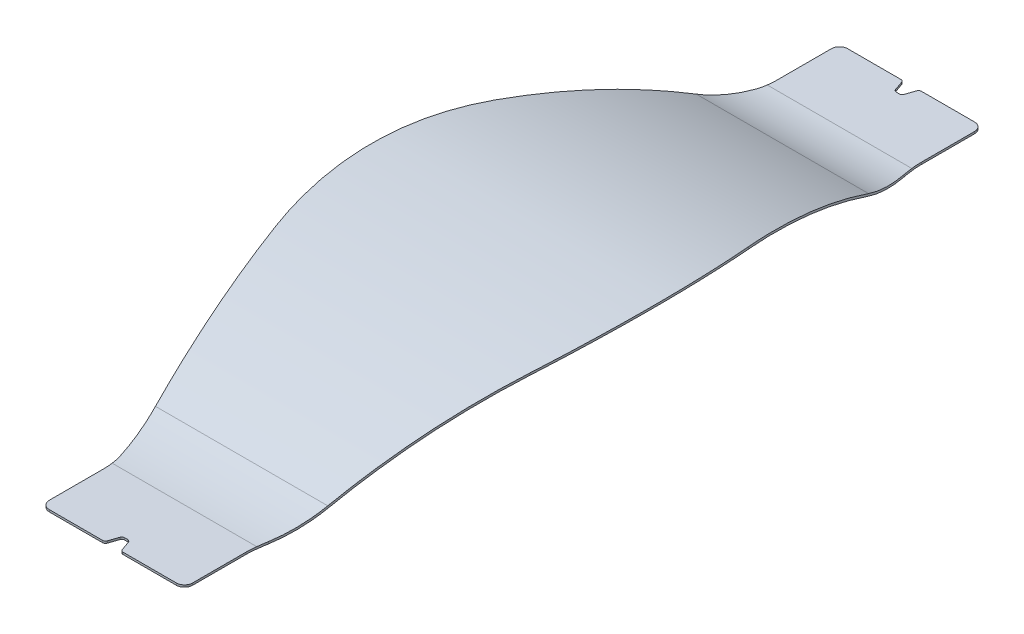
ISO-10303-21;
HEADER;
FILE_DESCRIPTION(('STEP AP214'),'2;1');
FILE_NAME('part.step','',(''),(''),'','','');
FILE_SCHEMA(('AUTOMOTIVE_DESIGN { 1 0 10303 214 1 1 1 1 }'));
ENDSEC;
DATA;
#1=APPLICATION_CONTEXT('core data for automotive mechanical design processes');
#2=APPLICATION_PROTOCOL_DEFINITION('international standard','automotive_design',2000,#1);
#3=PRODUCT_CONTEXT('',#1,'mechanical');
#4=PRODUCT('Part','Part','',(#3));
#5=PRODUCT_RELATED_PRODUCT_CATEGORY('part','',(#4));
#6=PRODUCT_DEFINITION_FORMATION('','',#4);
#7=PRODUCT_DEFINITION_CONTEXT('part definition',#1,'design');
#8=PRODUCT_DEFINITION('design','',#6,#7);
#9=PRODUCT_DEFINITION_SHAPE('','',#8);
#10=(LENGTH_UNIT() NAMED_UNIT(*) SI_UNIT(.MILLI.,.METRE.));
#11=(NAMED_UNIT(*) PLANE_ANGLE_UNIT() SI_UNIT($,.RADIAN.));
#12=(NAMED_UNIT(*) SI_UNIT($,.STERADIAN.) SOLID_ANGLE_UNIT());
#13=UNCERTAINTY_MEASURE_WITH_UNIT(LENGTH_MEASURE(1.E-05),#10,'distance_accuracy_value','');
#14=(GEOMETRIC_REPRESENTATION_CONTEXT(3) GLOBAL_UNCERTAINTY_ASSIGNED_CONTEXT((#13)) GLOBAL_UNIT_ASSIGNED_CONTEXT((#10,
#11,#12)) REPRESENTATION_CONTEXT('',''));
#15=CARTESIAN_POINT('',(0.,0.,0.));
#16=DIRECTION('',(0.,0.,1.));
#17=DIRECTION('',(1.,0.,0.));
#18=AXIS2_PLACEMENT_3D('',#15,#16,#17);
#19=CARTESIAN_POINT('',(151.199999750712,-0.373166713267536,322.56));
#20=DIRECTION('',(0.,-1.,0.));
#21=DIRECTION('',(0.,0.,-1.));
#22=AXIS2_PLACEMENT_3D('',#19,#20,#21);
#23=PLANE('',#22);
#24=DIRECTION('',(-1.,0.,0.));
#25=VECTOR('',#24,1.);
#26=CARTESIAN_POINT('',(151.199999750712,-0.373166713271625,393.12));
#27=LINE('',#26,#25);
#28=CARTESIAN_POINT('',(-10.217278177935,-0.373166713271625,393.12));
#29=VERTEX_POINT('',#28);
#30=CARTESIAN_POINT('',(-62.4960002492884,-0.373166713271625,393.12));
#31=VERTEX_POINT('',#30);
#32=EDGE_CURVE('E763',#29,#31,#27,.T.);
#33=ORIENTED_EDGE('',*,*,#32,.T.);
#34=CARTESIAN_POINT('',(-62.4960002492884,-0.373166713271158,385.056));
#35=DIRECTION('',(0.,-1.,0.));
#36=DIRECTION('',(0.,0.,-1.));
#37=AXIS2_PLACEMENT_3D('',#34,#35,#36);
#38=CIRCLE('',#37,8.064);
#39=CARTESIAN_POINT('',(-70.5600002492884,-0.373166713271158,385.056));
#40=VERTEX_POINT('',#39);
#41=EDGE_CURVE('E742',#31,#40,#38,.T.);
#42=ORIENTED_EDGE('',*,*,#41,.T.);
#43=DIRECTION('',(0.,0.,1.));
#44=VECTOR('',#43,1.);
#45=CARTESIAN_POINT('',(-70.5600002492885,-0.373166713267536,322.56));
#46=LINE('',#45,#44);
#47=CARTESIAN_POINT('',(-70.5600002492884,-0.373166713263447,332.64));
#48=VERTEX_POINT('',#47);
#49=EDGE_CURVE('E1014',#48,#40,#46,.T.);
#50=ORIENTED_EDGE('',*,*,#49,.F.);
#51=CARTESIAN_POINT('',(-151.200000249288,-0.37316671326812,332.64));
#52=DIRECTION('',(0.,-1.,0.));
#53=DIRECTION('',(0.,0.,-1.));
#54=AXIS2_PLACEMENT_3D('',#51,#52,#53);
#55=CIRCLE('',#54,80.64);
#56=CARTESIAN_POINT('',(-71.1924806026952,-0.373166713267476,322.56));
#57=VERTEX_POINT('',#56);
#58=EDGE_CURVE('E586',#57,#48,#55,.T.);
#59=ORIENTED_EDGE('',*,*,#58,.F.);
#60=DIRECTION('',(-1.,0.,0.));
#61=VECTOR('',#60,1.);
#62=CARTESIAN_POINT('',(151.199999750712,-0.37316671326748,322.56));
#63=LINE('',#62,#61);
#64=CARTESIAN_POINT('',(71.1924801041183,-0.373166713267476,322.56));
#65=VERTEX_POINT('',#64);
#66=EDGE_CURVE('E675',#65,#57,#63,.T.);
#67=ORIENTED_EDGE('',*,*,#66,.F.);
#68=CARTESIAN_POINT('',(151.199999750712,-0.37316671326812,332.64));
#69=DIRECTION('',(0.,-1.,0.));
#70=DIRECTION('',(0.,0.,-1.));
#71=AXIS2_PLACEMENT_3D('',#68,#69,#70);
#72=CIRCLE('',#71,80.64);
#73=CARTESIAN_POINT('',(70.5599997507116,-0.373166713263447,332.64));
#74=VERTEX_POINT('',#73);
#75=EDGE_CURVE('E568',#65,#74,#72,.F.);
#76=ORIENTED_EDGE('',*,*,#75,.T.);
#77=DIRECTION('',(0.,0.,1.));
#78=VECTOR('',#77,1.);
#79=CARTESIAN_POINT('',(70.5599997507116,-0.373166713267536,322.56));
#80=LINE('',#79,#78);
#81=CARTESIAN_POINT('',(70.5599997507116,-0.373166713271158,385.056));
#82=VERTEX_POINT('',#81);
#83=EDGE_CURVE('E634',#74,#82,#80,.T.);
#84=ORIENTED_EDGE('',*,*,#83,.T.);
#85=CARTESIAN_POINT('',(62.4959997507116,-0.373166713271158,385.056));
#86=DIRECTION('',(0.,-1.,0.));
#87=DIRECTION('',(0.,0.,-1.));
#88=AXIS2_PLACEMENT_3D('',#85,#86,#87);
#89=CIRCLE('',#88,8.064);
#90=CARTESIAN_POINT('',(62.4959997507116,-0.373166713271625,393.12));
#91=VERTEX_POINT('',#90);
#92=EDGE_CURVE('E739',#82,#91,#89,.T.);
#93=ORIENTED_EDGE('',*,*,#92,.T.);
#94=CARTESIAN_POINT('',(10.2172776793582,-0.373166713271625,393.12));
#95=VERTEX_POINT('',#94);
#96=EDGE_CURVE('E757',#91,#95,#27,.T.);
#97=ORIENTED_EDGE('',*,*,#96,.T.);
#98=CARTESIAN_POINT('',(10.2172776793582,-0.373166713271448,390.096));
#99=DIRECTION('',(0.,-1.,0.));
#100=DIRECTION('',(0.,0.,-1.));
#101=AXIS2_PLACEMENT_3D('',#98,#99,#100);
#102=CIRCLE('',#101,3.024);
#103=CARTESIAN_POINT('',(7.3596397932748,-0.373166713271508,391.085182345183));
#104=VERTEX_POINT('',#103);
#105=EDGE_CURVE('E852',#95,#104,#102,.T.);
#106=ORIENTED_EDGE('',*,*,#105,.T.);
#107=DIRECTION('',(-0.327110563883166,0.,-0.944986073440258));
#108=VECTOR('',#107,1.);
#109=CARTESIAN_POINT('',(1.56859156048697,-0.373166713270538,374.355487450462));
#110=LINE('',#109,#108);
#111=CARTESIAN_POINT('',(4.23235970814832,-0.373166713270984,382.050817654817));
#112=VERTEX_POINT('',#111);
#113=EDGE_CURVE('E822',#104,#112,#110,.T.);
#114=ORIENTED_EDGE('',*,*,#113,.T.);
#115=CARTESIAN_POINT('',(1.37472182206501,-0.373166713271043,383.04));
#116=DIRECTION('',(0.,-1.,0.));
#117=DIRECTION('',(0.,0.,-1.));
#118=AXIS2_PLACEMENT_3D('',#115,#116,#117);
#119=CIRCLE('',#118,3.024);
#120=CARTESIAN_POINT('',(1.37472182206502,-0.373166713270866,380.016));
#121=VERTEX_POINT('',#120);
#122=EDGE_CURVE('E909',#112,#121,#119,.F.);
#123=ORIENTED_EDGE('',*,*,#122,.T.);
#124=DIRECTION('',(-1.,0.,0.));
#125=VECTOR('',#124,1.);
#126=CARTESIAN_POINT('',(151.199999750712,-0.373166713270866,380.016));
#127=LINE('',#126,#125);
#128=CARTESIAN_POINT('',(-1.37472232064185,-0.373166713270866,380.016));
#129=VERTEX_POINT('',#128);
#130=EDGE_CURVE('E819',#121,#129,#127,.T.);
#131=ORIENTED_EDGE('',*,*,#130,.T.);
#132=CARTESIAN_POINT('',(-1.37472232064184,-0.373166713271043,383.04));
#133=DIRECTION('',(0.,-1.,0.));
#134=DIRECTION('',(0.,0.,-1.));
#135=AXIS2_PLACEMENT_3D('',#132,#133,#134);
#136=CIRCLE('',#135,3.024);
#137=CARTESIAN_POINT('',(-4.23236020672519,-0.373166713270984,382.050817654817));
#138=VERTEX_POINT('',#137);
#139=EDGE_CURVE('E913',#129,#138,#136,.F.);
#140=ORIENTED_EDGE('',*,*,#139,.T.);
#141=DIRECTION('',(0.327110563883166,0.,-0.944986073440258));
#142=VECTOR('',#141,1.);
#143=CARTESIAN_POINT('',(30.7886074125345,-0.373166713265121,280.8791334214));
#144=LINE('',#143,#142);
#145=CARTESIAN_POINT('',(-7.35964029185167,-0.373166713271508,391.085182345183));
#146=VERTEX_POINT('',#145);
#147=EDGE_CURVE('E831',#146,#138,#144,.T.);
#148=ORIENTED_EDGE('',*,*,#147,.F.);
#149=CARTESIAN_POINT('',(-10.217278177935,-0.37316671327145,390.096));
#150=DIRECTION('',(0.,-1.,0.));
#151=DIRECTION('',(0.,0.,-1.));
#152=AXIS2_PLACEMENT_3D('',#149,#150,#151);
#153=CIRCLE('',#152,3.024);
#154=EDGE_CURVE('E851',#146,#29,#153,.T.);
#155=ORIENTED_EDGE('',*,*,#154,.T.);
#156=EDGE_LOOP('',(#33,#42,#50,#59,#67,#76,#84,#93,#97,#106,#114,#123,#131,#140,#148,#155));
#157=FACE_BOUND('',#156,.T.);
#158=ADVANCED_FACE('F43',(#157),#23,.T.);
#159=CARTESIAN_POINT('',(151.199999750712,1.64283328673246,322.56));
#160=DIRECTION('',(0.,-1.,0.));
#161=DIRECTION('',(0.,0.,-1.));
#162=AXIS2_PLACEMENT_3D('',#159,#160,#161);
#163=PLANE('',#162);
#164=DIRECTION('',(0.,0.,1.));
#165=VECTOR('',#164,1.);
#166=CARTESIAN_POINT('',(-70.5600002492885,1.64283328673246,322.56));
#167=LINE('',#166,#165);
#168=CARTESIAN_POINT('',(-70.5600002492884,1.64283328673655,332.64));
#169=VERTEX_POINT('',#168);
#170=CARTESIAN_POINT('',(-70.5600002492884,1.64283328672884,385.056));
#171=VERTEX_POINT('',#170);
#172=EDGE_CURVE('E1020',#169,#171,#167,.T.);
#173=ORIENTED_EDGE('',*,*,#172,.T.);
#174=CARTESIAN_POINT('',(-62.4960002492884,1.64283328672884,385.056));
#175=DIRECTION('',(0.,-1.,0.));
#176=DIRECTION('',(0.,0.,-1.));
#177=AXIS2_PLACEMENT_3D('',#174,#175,#176);
#178=CIRCLE('',#177,8.064);
#179=CARTESIAN_POINT('',(-62.4960002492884,1.64283328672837,393.12));
#180=VERTEX_POINT('',#179);
#181=EDGE_CURVE('E750',#171,#180,#178,.F.);
#182=ORIENTED_EDGE('',*,*,#181,.T.);
#183=DIRECTION('',(-1.,0.,0.));
#184=VECTOR('',#183,1.);
#185=CARTESIAN_POINT('',(151.199999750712,1.64283328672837,393.12));
#186=LINE('',#185,#184);
#187=CARTESIAN_POINT('',(-10.217278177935,1.64283328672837,393.12));
#188=VERTEX_POINT('',#187);
#189=EDGE_CURVE('E670',#188,#180,#186,.T.);
#190=ORIENTED_EDGE('',*,*,#189,.F.);
#191=CARTESIAN_POINT('',(-10.217278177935,1.64283328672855,390.096));
#192=DIRECTION('',(0.,-1.,0.));
#193=DIRECTION('',(0.,0.,-1.));
#194=AXIS2_PLACEMENT_3D('',#191,#192,#193);
#195=CIRCLE('',#194,3.024);
#196=CARTESIAN_POINT('',(-7.35964029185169,1.64283328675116,391.085182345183));
#197=VERTEX_POINT('',#196);
#198=EDGE_CURVE('E849',#188,#197,#195,.F.);
#199=ORIENTED_EDGE('',*,*,#198,.T.);
#200=DIRECTION('',(-0.327110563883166,0.,0.944986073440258));
#201=VECTOR('',#200,1.);
#202=CARTESIAN_POINT('',(-3.52800024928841,1.64283328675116,380.016));
#203=LINE('',#202,#201);
#204=CARTESIAN_POINT('',(-4.23236020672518,1.64283328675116,382.050817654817));
#205=VERTEX_POINT('',#204);
#206=EDGE_CURVE('E834',#205,#197,#203,.T.);
#207=ORIENTED_EDGE('',*,*,#206,.F.);
#208=CARTESIAN_POINT('',(-1.37472232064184,1.64283328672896,383.04));
#209=DIRECTION('',(0.,-1.,0.));
#210=DIRECTION('',(0.,0.,-1.));
#211=AXIS2_PLACEMENT_3D('',#208,#209,#210);
#212=CIRCLE('',#211,3.024);
#213=CARTESIAN_POINT('',(-1.37472232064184,1.64283328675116,380.016));
#214=VERTEX_POINT('',#213);
#215=EDGE_CURVE('E911',#205,#214,#212,.T.);
#216=ORIENTED_EDGE('',*,*,#215,.T.);
#217=DIRECTION('',(1.,0.,0.));
#218=VECTOR('',#217,1.);
#219=CARTESIAN_POINT('',(-2.49288408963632E-07,1.64283328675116,380.016));
#220=LINE('',#219,#218);
#221=CARTESIAN_POINT('',(1.37472182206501,1.64283328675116,380.016));
#222=VERTEX_POINT('',#221);
#223=EDGE_CURVE('E825',#214,#222,#220,.T.);
#224=ORIENTED_EDGE('',*,*,#223,.T.);
#225=CARTESIAN_POINT('',(1.37472182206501,1.64283328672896,383.04));
#226=DIRECTION('',(0.,-1.,0.));
#227=DIRECTION('',(0.,0.,-1.));
#228=AXIS2_PLACEMENT_3D('',#225,#226,#227);
#229=CIRCLE('',#228,3.024);
#230=CARTESIAN_POINT('',(4.23235970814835,1.64283328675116,382.050817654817));
#231=VERTEX_POINT('',#230);
#232=EDGE_CURVE('E907',#222,#231,#229,.T.);
#233=ORIENTED_EDGE('',*,*,#232,.T.);
#234=DIRECTION('',(0.327110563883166,0.,0.944986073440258));
#235=VECTOR('',#234,1.);
#236=CARTESIAN_POINT('',(3.52799975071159,1.64283328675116,380.016));
#237=LINE('',#236,#235);
#238=CARTESIAN_POINT('',(7.35963979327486,1.64283328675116,391.085182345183));
#239=VERTEX_POINT('',#238);
#240=EDGE_CURVE('E828',#231,#239,#237,.T.);
#241=ORIENTED_EDGE('',*,*,#240,.T.);
#242=CARTESIAN_POINT('',(10.2172776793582,1.64283328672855,390.096));
#243=DIRECTION('',(0.,-1.,0.));
#244=DIRECTION('',(0.,0.,-1.));
#245=AXIS2_PLACEMENT_3D('',#242,#243,#244);
#246=CIRCLE('',#245,3.024);
#247=CARTESIAN_POINT('',(10.2172776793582,1.64283328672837,393.12));
#248=VERTEX_POINT('',#247);
#249=EDGE_CURVE('E1034',#239,#248,#246,.F.);
#250=ORIENTED_EDGE('',*,*,#249,.T.);
#251=CARTESIAN_POINT('',(62.4959997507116,1.64283328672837,393.12));
#252=VERTEX_POINT('',#251);
#253=EDGE_CURVE('E664',#252,#248,#186,.T.);
#254=ORIENTED_EDGE('',*,*,#253,.F.);
#255=CARTESIAN_POINT('',(62.4959997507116,1.64283328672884,385.056));
#256=DIRECTION('',(0.,-1.,0.));
#257=DIRECTION('',(0.,0.,-1.));
#258=AXIS2_PLACEMENT_3D('',#255,#256,#257);
#259=CIRCLE('',#258,8.064);
#260=CARTESIAN_POINT('',(70.5599997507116,1.64283328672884,385.056));
#261=VERTEX_POINT('',#260);
#262=EDGE_CURVE('E61',#252,#261,#259,.F.);
#263=ORIENTED_EDGE('',*,*,#262,.T.);
#264=DIRECTION('',(0.,0.,1.));
#265=VECTOR('',#264,1.);
#266=CARTESIAN_POINT('',(70.5599997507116,1.64283328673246,322.56));
#267=LINE('',#266,#265);
#268=CARTESIAN_POINT('',(70.5599997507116,1.64283328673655,332.64));
#269=VERTEX_POINT('',#268);
#270=EDGE_CURVE('E626',#269,#261,#267,.T.);
#271=ORIENTED_EDGE('',*,*,#270,.F.);
#272=CARTESIAN_POINT('',(151.199999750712,1.64283328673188,332.64));
#273=DIRECTION('',(0.,-1.,0.));
#274=DIRECTION('',(0.,0.,-1.));
#275=AXIS2_PLACEMENT_3D('',#272,#273,#274);
#276=CIRCLE('',#275,80.64);
#277=CARTESIAN_POINT('',(71.1924801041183,1.64283328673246,322.56));
#278=VERTEX_POINT('',#277);
#279=EDGE_CURVE('E646',#278,#269,#276,.F.);
#280=ORIENTED_EDGE('',*,*,#279,.F.);
#281=DIRECTION('',(-1.,0.,0.));
#282=VECTOR('',#281,1.);
#283=CARTESIAN_POINT('',(151.199999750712,1.64283328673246,322.56));
#284=LINE('',#283,#282);
#285=CARTESIAN_POINT('',(-71.1924806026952,1.64283328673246,322.56));
#286=VERTEX_POINT('',#285);
#287=EDGE_CURVE('E655',#278,#286,#284,.T.);
#288=ORIENTED_EDGE('',*,*,#287,.T.);
#289=CARTESIAN_POINT('',(-151.200000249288,1.64283328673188,332.64));
#290=DIRECTION('',(0.,-1.,0.));
#291=DIRECTION('',(0.,0.,-1.));
#292=AXIS2_PLACEMENT_3D('',#289,#290,#291);
#293=CIRCLE('',#292,80.64);
#294=EDGE_CURVE('E992',#286,#169,#293,.T.);
#295=ORIENTED_EDGE('',*,*,#294,.T.);
#296=EDGE_LOOP('',(#173,#182,#190,#199,#207,#216,#224,#233,#241,#250,#254,#263,#271,#280,#288,#295));
#297=FACE_BOUND('',#296,.T.);
#298=ADVANCED_FACE('F653',(#297),#163,.F.);
#299=CARTESIAN_POINT('',(151.199999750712,1.64283328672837,393.12));
#300=DIRECTION('',(0.,0.,-1.));
#301=DIRECTION('',(0.,1.,0.));
#302=AXIS2_PLACEMENT_3D('',#299,#300,#301);
#303=PLANE('',#302);
#304=ORIENTED_EDGE('',*,*,#189,.T.);
#305=DIRECTION('',(0.,-1.,0.));
#306=VECTOR('',#305,1.);
#307=CARTESIAN_POINT('',(-62.4960002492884,1.64283328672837,393.12));
#308=LINE('',#307,#306);
#309=EDGE_CURVE('E731',#180,#31,#308,.T.);
#310=ORIENTED_EDGE('',*,*,#309,.T.);
#311=ORIENTED_EDGE('',*,*,#32,.F.);
#312=DIRECTION('',(0.,1.,0.));
#313=VECTOR('',#312,1.);
#314=CARTESIAN_POINT('',(-10.217278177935,1.64283328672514,393.12));
#315=LINE('',#314,#313);
#316=EDGE_CURVE('E463',#29,#188,#315,.T.);
#317=ORIENTED_EDGE('',*,*,#316,.T.);
#318=EDGE_LOOP('',(#304,#310,#311,#317));
#319=FACE_BOUND('',#318,.T.);
#320=ADVANCED_FACE('F1033',(#319),#303,.F.);
#321=ORIENTED_EDGE('',*,*,#96,.F.);
#322=DIRECTION('',(0.,-1.,0.));
#323=VECTOR('',#322,1.);
#324=CARTESIAN_POINT('',(62.4959997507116,1.64283328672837,393.12));
#325=LINE('',#324,#323);
#326=EDGE_CURVE('E11',#91,#252,#325,.F.);
#327=ORIENTED_EDGE('',*,*,#326,.T.);
#328=ORIENTED_EDGE('',*,*,#253,.T.);
#329=DIRECTION('',(0.,1.,0.));
#330=VECTOR('',#329,1.);
#331=CARTESIAN_POINT('',(10.2172776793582,-0.373166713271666,393.12));
#332=LINE('',#331,#330);
#333=EDGE_CURVE('E761',#248,#95,#332,.F.);
#334=ORIENTED_EDGE('',*,*,#333,.T.);
#335=EDGE_LOOP('',(#321,#327,#328,#334));
#336=FACE_BOUND('',#335,.T.);
#337=ADVANCED_FACE('F759',(#336),#303,.F.);
#338=CARTESIAN_POINT('',(151.199999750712,-0.373166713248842,-322.56));
#339=DIRECTION('',(0.,1.,0.));
#340=DIRECTION('',(0.,0.,1.));
#341=AXIS2_PLACEMENT_3D('',#338,#339,#340);
#342=PLANE('',#341);
#343=DIRECTION('',(-1.,0.,0.));
#344=VECTOR('',#343,1.);
#345=CARTESIAN_POINT('',(151.199999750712,-0.373166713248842,-393.12));
#346=LINE('',#345,#344);
#347=CARTESIAN_POINT('',(62.4959997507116,-0.373166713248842,-393.12));
#348=VERTEX_POINT('',#347);
#349=CARTESIAN_POINT('',(10.2172776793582,-0.373166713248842,-393.12));
#350=VERTEX_POINT('',#349);
#351=EDGE_CURVE('E695',#348,#350,#346,.T.);
#352=ORIENTED_EDGE('',*,*,#351,.F.);
#353=CARTESIAN_POINT('',(62.4959997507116,-0.373166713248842,-385.056));
#354=DIRECTION('',(0.,1.,0.));
#355=DIRECTION('',(0.,0.,1.));
#356=AXIS2_PLACEMENT_3D('',#353,#354,#355);
#357=CIRCLE('',#356,8.064);
#358=CARTESIAN_POINT('',(70.5599997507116,-0.373166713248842,-385.056));
#359=VERTEX_POINT('',#358);
#360=EDGE_CURVE('E726',#348,#359,#357,.F.);
#361=ORIENTED_EDGE('',*,*,#360,.T.);
#362=DIRECTION('',(0.,0.,1.));
#363=VECTOR('',#362,1.);
#364=CARTESIAN_POINT('',(70.5599997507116,-0.373166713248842,-322.56));
#365=LINE('',#364,#363);
#366=CARTESIAN_POINT('',(70.5599997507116,-0.373172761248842,-332.64));
#367=VERTEX_POINT('',#366);
#368=EDGE_CURVE('E526',#359,#367,#365,.T.);
#369=ORIENTED_EDGE('',*,*,#368,.T.);
#370=CARTESIAN_POINT('',(151.199999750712,-0.373166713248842,-332.64));
#371=DIRECTION('',(0.,1.,0.));
#372=DIRECTION('',(0.,0.,1.));
#373=AXIS2_PLACEMENT_3D('',#370,#371,#372);
#374=CIRCLE('',#373,80.64);
#375=CARTESIAN_POINT('',(71.1924801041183,-0.373166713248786,-322.56));
#376=VERTEX_POINT('',#375);
#377=EDGE_CURVE('E514',#376,#367,#374,.F.);
#378=ORIENTED_EDGE('',*,*,#377,.F.);
#379=DIRECTION('',(-1.,0.,0.));
#380=VECTOR('',#379,1.);
#381=CARTESIAN_POINT('',(151.199999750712,-0.373166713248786,-322.56));
#382=LINE('',#381,#380);
#383=CARTESIAN_POINT('',(-71.1924806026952,-0.373166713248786,-322.56));
#384=VERTEX_POINT('',#383);
#385=EDGE_CURVE('E678',#376,#384,#382,.T.);
#386=ORIENTED_EDGE('',*,*,#385,.T.);
#387=CARTESIAN_POINT('',(-151.200000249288,-0.373166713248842,-332.64));
#388=DIRECTION('',(0.,1.,0.));
#389=DIRECTION('',(0.,0.,1.));
#390=AXIS2_PLACEMENT_3D('',#387,#388,#389);
#391=CIRCLE('',#390,80.64);
#392=CARTESIAN_POINT('',(-70.5600002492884,-0.373166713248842,-332.64));
#393=VERTEX_POINT('',#392);
#394=EDGE_CURVE('E423',#393,#384,#391,.F.);
#395=ORIENTED_EDGE('',*,*,#394,.F.);
#396=DIRECTION('',(0.,0.,1.));
#397=VECTOR('',#396,1.);
#398=CARTESIAN_POINT('',(-70.5600002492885,-0.373166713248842,-322.56));
#399=LINE('',#398,#397);
#400=CARTESIAN_POINT('',(-70.5600002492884,-0.373166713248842,-385.056));
#401=VERTEX_POINT('',#400);
#402=EDGE_CURVE('E395',#401,#393,#399,.T.);
#403=ORIENTED_EDGE('',*,*,#402,.F.);
#404=CARTESIAN_POINT('',(-62.4960002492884,-0.373166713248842,-385.056));
#405=DIRECTION('',(0.,1.,0.));
#406=DIRECTION('',(0.,0.,1.));
#407=AXIS2_PLACEMENT_3D('',#404,#405,#406);
#408=CIRCLE('',#407,8.064);
#409=CARTESIAN_POINT('',(-62.4960002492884,-0.373166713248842,-393.12));
#410=VERTEX_POINT('',#409);
#411=EDGE_CURVE('E722',#401,#410,#408,.F.);
#412=ORIENTED_EDGE('',*,*,#411,.T.);
#413=CARTESIAN_POINT('',(-10.217278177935,-0.373166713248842,-393.12));
#414=VERTEX_POINT('',#413);
#415=EDGE_CURVE('E694',#414,#410,#346,.T.);
#416=ORIENTED_EDGE('',*,*,#415,.F.);
#417=CARTESIAN_POINT('',(-10.217278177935,-0.373166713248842,-390.096));
#418=DIRECTION('',(0.,1.,0.));
#419=DIRECTION('',(0.,0.,1.));
#420=AXIS2_PLACEMENT_3D('',#417,#418,#419);
#421=CIRCLE('',#420,3.024);
#422=CARTESIAN_POINT('',(-7.35964029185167,-0.373166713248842,-391.085182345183));
#423=VERTEX_POINT('',#422);
#424=EDGE_CURVE('E893',#414,#423,#421,.F.);
#425=ORIENTED_EDGE('',*,*,#424,.T.);
#426=DIRECTION('',(-0.327110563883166,0.,-0.944986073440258));
#427=VECTOR('',#426,1.);
#428=CARTESIAN_POINT('',(30.7886074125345,-0.373166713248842,-280.8791334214));
#429=LINE('',#428,#427);
#430=CARTESIAN_POINT('',(-4.23236020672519,-0.373166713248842,-382.050817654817));
#431=VERTEX_POINT('',#430);
#432=EDGE_CURVE('E811',#431,#423,#429,.T.);
#433=ORIENTED_EDGE('',*,*,#432,.F.);
#434=CARTESIAN_POINT('',(-1.37472232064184,-0.373166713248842,-383.04));
#435=DIRECTION('',(0.,1.,0.));
#436=DIRECTION('',(0.,0.,1.));
#437=AXIS2_PLACEMENT_3D('',#434,#435,#436);
#438=CIRCLE('',#437,3.024);
#439=CARTESIAN_POINT('',(-1.37472232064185,-0.373166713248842,-380.016));
#440=VERTEX_POINT('',#439);
#441=EDGE_CURVE('E918',#431,#440,#438,.T.);
#442=ORIENTED_EDGE('',*,*,#441,.T.);
#443=DIRECTION('',(1.,0.,0.));
#444=VECTOR('',#443,1.);
#445=CARTESIAN_POINT('',(151.199999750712,-0.373166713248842,-380.016));
#446=LINE('',#445,#444);
#447=CARTESIAN_POINT('',(1.37472182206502,-0.373166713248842,-380.016));
#448=VERTEX_POINT('',#447);
#449=EDGE_CURVE('E401',#440,#448,#446,.T.);
#450=ORIENTED_EDGE('',*,*,#449,.T.);
#451=CARTESIAN_POINT('',(1.37472182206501,-0.373166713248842,-383.04));
#452=DIRECTION('',(0.,1.,0.));
#453=DIRECTION('',(0.,0.,1.));
#454=AXIS2_PLACEMENT_3D('',#451,#452,#453);
#455=CIRCLE('',#454,3.024);
#456=CARTESIAN_POINT('',(4.23235970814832,-0.373166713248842,-382.050817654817));
#457=VERTEX_POINT('',#456);
#458=EDGE_CURVE('E774',#448,#457,#455,.T.);
#459=ORIENTED_EDGE('',*,*,#458,.T.);
#460=DIRECTION('',(0.327110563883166,0.,-0.944986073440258));
#461=VECTOR('',#460,1.);
#462=CARTESIAN_POINT('',(1.56859156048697,-0.373166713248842,-374.355487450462));
#463=LINE('',#462,#461);
#464=CARTESIAN_POINT('',(7.3596397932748,-0.373166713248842,-391.085182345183));
#465=VERTEX_POINT('',#464);
#466=EDGE_CURVE('E409',#457,#465,#463,.T.);
#467=ORIENTED_EDGE('',*,*,#466,.T.);
#468=CARTESIAN_POINT('',(10.2172776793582,-0.373166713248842,-390.096));
#469=DIRECTION('',(0.,1.,0.));
#470=DIRECTION('',(0.,0.,1.));
#471=AXIS2_PLACEMENT_3D('',#468,#469,#470);
#472=CIRCLE('',#471,3.024);
#473=EDGE_CURVE('E890',#465,#350,#472,.F.);
#474=ORIENTED_EDGE('',*,*,#473,.T.);
#475=EDGE_LOOP('',(#352,#361,#369,#378,#386,#395,#403,#412,#416,#425,#433,#442,#450,#459,#467,#474));
#476=FACE_BOUND('',#475,.T.);
#477=ADVANCED_FACE('F788',(#476),#342,.F.);
#478=CARTESIAN_POINT('',(151.199999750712,1.64283328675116,-322.56));
#479=DIRECTION('',(0.,1.,0.));
#480=DIRECTION('',(0.,0.,1.));
#481=AXIS2_PLACEMENT_3D('',#478,#479,#480);
#482=PLANE('',#481);
#483=DIRECTION('',(0.,0.,1.));
#484=VECTOR('',#483,1.);
#485=CARTESIAN_POINT('',(70.5599997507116,1.64283328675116,-322.56));
#486=LINE('',#485,#484);
#487=CARTESIAN_POINT('',(70.5599997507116,1.64283328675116,-385.056));
#488=VERTEX_POINT('',#487);
#489=CARTESIAN_POINT('',(70.5599997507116,1.64283328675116,-332.64));
#490=VERTEX_POINT('',#489);
#491=EDGE_CURVE('E658',#488,#490,#486,.T.);
#492=ORIENTED_EDGE('',*,*,#491,.F.);
#493=CARTESIAN_POINT('',(62.4959997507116,1.64283328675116,-385.056));
#494=DIRECTION('',(0.,1.,0.));
#495=DIRECTION('',(0.,0.,1.));
#496=AXIS2_PLACEMENT_3D('',#493,#494,#495);
#497=CIRCLE('',#496,8.064);
#498=CARTESIAN_POINT('',(62.4959997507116,1.64283328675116,-393.12));
#499=VERTEX_POINT('',#498);
#500=EDGE_CURVE('E782',#488,#499,#497,.T.);
#501=ORIENTED_EDGE('',*,*,#500,.T.);
#502=DIRECTION('',(-1.,0.,0.));
#503=VECTOR('',#502,1.);
#504=CARTESIAN_POINT('',(151.199999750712,1.64283328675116,-393.12));
#505=LINE('',#504,#503);
#506=CARTESIAN_POINT('',(10.2172776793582,1.64283328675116,-393.12));
#507=VERTEX_POINT('',#506);
#508=EDGE_CURVE('E692',#499,#507,#505,.T.);
#509=ORIENTED_EDGE('',*,*,#508,.T.);
#510=CARTESIAN_POINT('',(10.2172776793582,1.64283328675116,-390.096));
#511=DIRECTION('',(0.,1.,0.));
#512=DIRECTION('',(0.,0.,1.));
#513=AXIS2_PLACEMENT_3D('',#510,#511,#512);
#514=CIRCLE('',#513,3.024);
#515=CARTESIAN_POINT('',(7.35963979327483,1.64283328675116,-391.085182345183));
#516=VERTEX_POINT('',#515);
#517=EDGE_CURVE('E884',#507,#516,#514,.T.);
#518=ORIENTED_EDGE('',*,*,#517,.T.);
#519=DIRECTION('',(0.327110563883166,0.,-0.944986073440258));
#520=VECTOR('',#519,1.);
#521=CARTESIAN_POINT('',(3.52799975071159,1.64283328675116,-380.016));
#522=LINE('',#521,#520);
#523=CARTESIAN_POINT('',(4.23235970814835,1.64283328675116,-382.050817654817));
#524=VERTEX_POINT('',#523);
#525=EDGE_CURVE('E803',#524,#516,#522,.T.);
#526=ORIENTED_EDGE('',*,*,#525,.F.);
#527=CARTESIAN_POINT('',(1.37472182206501,1.64283328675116,-383.04));
#528=DIRECTION('',(0.,1.,0.));
#529=DIRECTION('',(0.,0.,1.));
#530=AXIS2_PLACEMENT_3D('',#527,#528,#529);
#531=CIRCLE('',#530,3.024);
#532=CARTESIAN_POINT('',(1.37472182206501,1.64283328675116,-380.016));
#533=VERTEX_POINT('',#532);
#534=EDGE_CURVE('E920',#524,#533,#531,.F.);
#535=ORIENTED_EDGE('',*,*,#534,.T.);
#536=DIRECTION('',(1.,0.,0.));
#537=VECTOR('',#536,1.);
#538=CARTESIAN_POINT('',(-2.49288408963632E-07,1.64283328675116,-380.016));
#539=LINE('',#538,#537);
#540=CARTESIAN_POINT('',(-1.37472232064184,1.64283328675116,-380.016));
#541=VERTEX_POINT('',#540);
#542=EDGE_CURVE('E807',#541,#533,#539,.T.);
#543=ORIENTED_EDGE('',*,*,#542,.F.);
#544=CARTESIAN_POINT('',(-1.37472232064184,1.64283328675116,-383.04));
#545=DIRECTION('',(0.,1.,0.));
#546=DIRECTION('',(0.,0.,1.));
#547=AXIS2_PLACEMENT_3D('',#544,#545,#546);
#548=CIRCLE('',#547,3.024);
#549=CARTESIAN_POINT('',(-4.23236020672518,1.64283328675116,-382.050817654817));
#550=VERTEX_POINT('',#549);
#551=EDGE_CURVE('E915',#541,#550,#548,.F.);
#552=ORIENTED_EDGE('',*,*,#551,.T.);
#553=DIRECTION('',(-0.327110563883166,0.,-0.944986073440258));
#554=VECTOR('',#553,1.);
#555=CARTESIAN_POINT('',(-3.52800024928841,1.64283328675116,-380.016));
#556=LINE('',#555,#554);
#557=CARTESIAN_POINT('',(-7.35964029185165,1.64283328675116,-391.085182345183));
#558=VERTEX_POINT('',#557);
#559=EDGE_CURVE('E815',#550,#558,#556,.T.);
#560=ORIENTED_EDGE('',*,*,#559,.T.);
#561=CARTESIAN_POINT('',(-10.217278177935,1.64283328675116,-390.096));
#562=DIRECTION('',(0.,1.,0.));
#563=DIRECTION('',(0.,0.,1.));
#564=AXIS2_PLACEMENT_3D('',#561,#562,#563);
#565=CIRCLE('',#564,3.024);
#566=CARTESIAN_POINT('',(-10.217278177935,1.64283328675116,-393.12));
#567=VERTEX_POINT('',#566);
#568=EDGE_CURVE('E887',#558,#567,#565,.T.);
#569=ORIENTED_EDGE('',*,*,#568,.T.);
#570=CARTESIAN_POINT('',(-62.4960002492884,1.64283328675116,-393.12));
#571=VERTEX_POINT('',#570);
#572=EDGE_CURVE('E691',#567,#571,#505,.T.);
#573=ORIENTED_EDGE('',*,*,#572,.T.);
#574=CARTESIAN_POINT('',(-62.4960002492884,1.64283328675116,-385.056));
#575=DIRECTION('',(0.,1.,0.));
#576=DIRECTION('',(0.,0.,1.));
#577=AXIS2_PLACEMENT_3D('',#574,#575,#576);
#578=CIRCLE('',#577,8.064);
#579=CARTESIAN_POINT('',(-70.5600002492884,1.64283328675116,-385.056));
#580=VERTEX_POINT('',#579);
#581=EDGE_CURVE('E723',#571,#580,#578,.T.);
#582=ORIENTED_EDGE('',*,*,#581,.T.);
#583=DIRECTION('',(0.,0.,1.));
#584=VECTOR('',#583,1.);
#585=CARTESIAN_POINT('',(-70.5600002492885,1.64283328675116,-322.56));
#586=LINE('',#585,#584);
#587=CARTESIAN_POINT('',(-70.5600002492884,1.64283328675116,-332.64));
#588=VERTEX_POINT('',#587);
#589=EDGE_CURVE('E413',#580,#588,#586,.T.);
#590=ORIENTED_EDGE('',*,*,#589,.T.);
#591=CARTESIAN_POINT('',(-151.200000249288,1.64283328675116,-332.64));
#592=DIRECTION('',(0.,1.,0.));
#593=DIRECTION('',(0.,0.,1.));
#594=AXIS2_PLACEMENT_3D('',#591,#592,#593);
#595=CIRCLE('',#594,80.64);
#596=CARTESIAN_POINT('',(-71.1924806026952,1.64283328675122,-322.56));
#597=VERTEX_POINT('',#596);
#598=EDGE_CURVE('E436',#588,#597,#595,.F.);
#599=ORIENTED_EDGE('',*,*,#598,.T.);
#600=DIRECTION('',(-1.,0.,0.));
#601=VECTOR('',#600,1.);
#602=CARTESIAN_POINT('',(151.199999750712,1.64283328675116,-322.56));
#603=LINE('',#602,#601);
#604=CARTESIAN_POINT('',(71.1924801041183,1.64283328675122,-322.56));
#605=VERTEX_POINT('',#604);
#606=EDGE_CURVE('E687',#605,#597,#603,.T.);
#607=ORIENTED_EDGE('',*,*,#606,.F.);
#608=CARTESIAN_POINT('',(151.199999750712,1.64283328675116,-332.64));
#609=DIRECTION('',(0.,1.,0.));
#610=DIRECTION('',(0.,0.,1.));
#611=AXIS2_PLACEMENT_3D('',#608,#609,#610);
#612=CIRCLE('',#611,80.64);
#613=EDGE_CURVE('E513',#605,#490,#612,.F.);
#614=ORIENTED_EDGE('',*,*,#613,.T.);
#615=EDGE_LOOP('',(#492,#501,#509,#518,#526,#535,#543,#552,#560,#569,#573,#582,#590,#599,#607,#614));
#616=FACE_BOUND('',#615,.T.);
#617=ADVANCED_FACE('F939',(#616),#482,.T.);
#618=CARTESIAN_POINT('',(151.199999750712,1.64283328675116,-393.12));
#619=DIRECTION('',(0.,0.,-1.));
#620=DIRECTION('',(-1.,0.,0.));
#621=AXIS2_PLACEMENT_3D('',#618,#619,#620);
#622=PLANE('',#621);
#623=ORIENTED_EDGE('',*,*,#415,.T.);
#624=DIRECTION('',(0.,1.,0.));
#625=VECTOR('',#624,1.);
#626=CARTESIAN_POINT('',(-62.4960002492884,1.64283328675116,-393.12));
#627=LINE('',#626,#625);
#628=EDGE_CURVE('E712',#410,#571,#627,.T.);
#629=ORIENTED_EDGE('',*,*,#628,.T.);
#630=ORIENTED_EDGE('',*,*,#572,.F.);
#631=DIRECTION('',(0.,1.,0.));
#632=VECTOR('',#631,1.);
#633=CARTESIAN_POINT('',(-10.217278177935,1.64283328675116,-393.12));
#634=LINE('',#633,#632);
#635=EDGE_CURVE('E715',#567,#414,#634,.F.);
#636=ORIENTED_EDGE('',*,*,#635,.T.);
#637=EDGE_LOOP('',(#623,#629,#630,#636));
#638=FACE_BOUND('',#637,.T.);
#639=ADVANCED_FACE('F710',(#638),#622,.T.);
#640=ORIENTED_EDGE('',*,*,#508,.F.);
#641=DIRECTION('',(0.,1.,0.));
#642=VECTOR('',#641,1.);
#643=CARTESIAN_POINT('',(62.4959997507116,-0.373166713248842,-393.12));
#644=LINE('',#643,#642);
#645=EDGE_CURVE('E785',#499,#348,#644,.F.);
#646=ORIENTED_EDGE('',*,*,#645,.T.);
#647=ORIENTED_EDGE('',*,*,#351,.T.);
#648=DIRECTION('',(0.,-1.,0.));
#649=VECTOR('',#648,1.);
#650=CARTESIAN_POINT('',(10.2172776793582,1.64283328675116,-393.12));
#651=LINE('',#650,#649);
#652=EDGE_CURVE('E904',#350,#507,#651,.F.);
#653=ORIENTED_EDGE('',*,*,#652,.T.);
#654=EDGE_LOOP('',(#640,#646,#647,#653));
#655=FACE_BOUND('',#654,.T.);
#656=ADVANCED_FACE('F1308',(#655),#622,.T.);
#657=CARTESIAN_POINT('',(151.199999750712,-506.146984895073,0.));
#658=DIRECTION('',(-1.,0.,0.));
#659=DIRECTION('',(0.,0.,1.));
#660=AXIS2_PLACEMENT_3D('',#657,#658,#659);
#661=CYLINDRICAL_SURFACE('',#660,583.389818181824);
#662=CARTESIAN_POINT('',(-152.480000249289,-506.146984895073,0.));
#663=DIRECTION('',(-0.969230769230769,0.,-0.246153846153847));
#664=DIRECTION('',(-0.246153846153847,0.,0.969230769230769));
#665=AXIS2_PLACEMENT_3D('',#662,#663,#664);
#666=ELLIPSE('',#665,601.910129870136,583.389818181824);
#667=CARTESIAN_POINT('',(-85.0793256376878,13.3833269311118,-265.390156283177));
#668=VERTEX_POINT('',#667);
#669=CARTESIAN_POINT('',(-125.147077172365,67.2297560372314,-107.623384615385));
#670=VERTEX_POINT('',#669);
#671=EDGE_CURVE('E376',#668,#670,#666,.F.);
#672=ORIENTED_EDGE('',*,*,#671,.F.);
#673=DIRECTION('',(-1.,0.,0.));
#674=VECTOR('',#673,1.);
#675=CARTESIAN_POINT('',(151.199999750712,13.3833269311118,-265.390156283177));
#676=LINE('',#675,#674);
#677=CARTESIAN_POINT('',(85.0793251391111,13.3833269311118,-265.390156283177));
#678=VERTEX_POINT('',#677);
#679=EDGE_CURVE('E682',#678,#668,#676,.T.);
#680=ORIENTED_EDGE('',*,*,#679,.F.);
#681=CARTESIAN_POINT('',(152.479999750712,-506.146984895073,0.));
#682=DIRECTION('',(0.969230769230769,0.,-0.246153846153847));
#683=DIRECTION('',(-0.246153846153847,0.,-0.969230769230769));
#684=AXIS2_PLACEMENT_3D('',#681,#682,#683);
#685=ELLIPSE('',#684,601.910129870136,583.389818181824);
#686=CARTESIAN_POINT('',(125.147076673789,67.2297560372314,-107.623384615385));
#687=VERTEX_POINT('',#686);
#688=EDGE_CURVE('E969',#687,#678,#685,.F.);
#689=ORIENTED_EDGE('',*,*,#688,.F.);
#690=CARTESIAN_POINT('',(125.147076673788,67.2297560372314,-107.623384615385));
#691=CARTESIAN_POINT('',(125.705218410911,67.6422643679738,-105.425704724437));
#692=CARTESIAN_POINT('',(126.246781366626,68.0428873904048,-103.221637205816));
#693=CARTESIAN_POINT('',(127.296413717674,68.8199868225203,-98.801301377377));
#694=CARTESIAN_POINT('',(127.804483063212,69.1964631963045,-96.5850330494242));
#695=CARTESIAN_POINT('',(129.277947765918,70.289109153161,-89.9187825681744));
#696=CARTESIAN_POINT('',(130.192595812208,70.9684926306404,-85.4513705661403));
#697=CARTESIAN_POINT('',(131.883984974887,72.2263489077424,-76.4755472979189));
#698=CARTESIAN_POINT('',(132.660697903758,72.8048010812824,-71.9671278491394));
#699=CARTESIAN_POINT('',(134.073701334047,73.8581608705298,-62.916341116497));
#700=CARTESIAN_POINT('',(134.709994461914,74.3330704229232,-58.3739744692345));
#701=CARTESIAN_POINT('',(135.827047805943,75.1674347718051,-49.367981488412));
#702=CARTESIAN_POINT('',(136.311086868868,75.5293221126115,-44.9049868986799));
#703=CARTESIAN_POINT('',(137.141915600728,76.1508107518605,-35.9591471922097));
#704=CARTESIAN_POINT('',(137.488705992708,76.4104125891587,-31.4763021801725));
#705=CARTESIAN_POINT('',(138.043943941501,76.8261858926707,-22.4978977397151));
#706=CARTESIAN_POINT('',(138.252411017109,76.9823719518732,-18.0023401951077));
#707=CARTESIAN_POINT('',(138.530438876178,77.1906956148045,-9.00452176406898));
#708=CARTESIAN_POINT('',(138.599999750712,77.2428332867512,-4.50226088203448));
#709=CARTESIAN_POINT('',(138.599999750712,77.2428332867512,4.50226088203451));
#710=CARTESIAN_POINT('',(138.530438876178,77.1906956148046,9.00452176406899));
#711=CARTESIAN_POINT('',(138.252411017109,76.9823719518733,18.0023401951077));
#712=CARTESIAN_POINT('',(138.043943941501,76.8261858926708,22.497897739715));
#713=CARTESIAN_POINT('',(137.488705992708,76.4104125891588,31.4763021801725));
#714=CARTESIAN_POINT('',(137.141915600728,76.1508107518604,35.9591471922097));
#715=CARTESIAN_POINT('',(136.311086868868,75.5293221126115,44.9049868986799));
#716=CARTESIAN_POINT('',(135.827047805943,75.1674347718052,49.367981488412));
#717=CARTESIAN_POINT('',(134.709994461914,74.3330704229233,58.3739744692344));
#718=CARTESIAN_POINT('',(134.073701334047,73.8581608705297,62.9163411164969));
#719=CARTESIAN_POINT('',(132.660697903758,72.8048010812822,71.9671278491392));
#720=CARTESIAN_POINT('',(131.883984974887,72.2263489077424,76.4755472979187));
#721=CARTESIAN_POINT('',(130.192595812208,70.9684926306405,85.4513705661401));
#722=CARTESIAN_POINT('',(129.277947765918,70.289109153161,89.9187825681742));
#723=CARTESIAN_POINT('',(127.804483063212,69.1964631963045,96.585033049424));
#724=CARTESIAN_POINT('',(127.296413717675,68.8199868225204,98.8013013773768));
#725=CARTESIAN_POINT('',(126.246781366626,68.0428873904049,103.221637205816));
#726=CARTESIAN_POINT('',(125.705218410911,67.6422643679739,105.425704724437));
#727=CARTESIAN_POINT('',(125.147076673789,67.2297560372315,107.623384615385));
#728=B_SPLINE_CURVE_WITH_KNOTS('',3,(#690,#691,#692,#693,#694,#695,#696,#697,#698,#699,#700,
#701,#702,#703,#704,#705,#706,#707,#708,#709,#710,#711,#712,#713,#714,#715,#716,#717,#718,#719,
#720,#721,#722,#723,#724,#725,#726,#727),.UNSPECIFIED.,.F.,.F.,(4,2,2,2,2,2,2,2,2,2,2,2,2,2,2,2,
2,2,4),(0.,6.91379100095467,13.8275922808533,27.6552440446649,41.485718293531,55.3159338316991,
68.8238650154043,82.3317250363,95.8376785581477,109.343623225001,122.849567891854,
136.355521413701,149.863381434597,163.371312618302,177.20152815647,191.032002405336,
204.859654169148,211.773455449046,218.687246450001),.UNSPECIFIED.);
#729=CARTESIAN_POINT('',(125.147076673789,67.2297560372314,107.623384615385));
#730=VERTEX_POINT('',#729);
#731=EDGE_CURVE('E484',#687,#730,#728,.T.);
#732=ORIENTED_EDGE('',*,*,#731,.T.);
#733=CARTESIAN_POINT('',(152.479999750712,-506.146984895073,0.));
#734=DIRECTION('',(0.969230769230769,0.,0.246153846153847));
#735=DIRECTION('',(-0.246153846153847,0.,0.969230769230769));
#736=AXIS2_PLACEMENT_3D('',#733,#734,#735);
#737=ELLIPSE('',#736,601.910129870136,583.389818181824);
#738=CARTESIAN_POINT('',(85.0793251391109,13.3833269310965,265.390156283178));
#739=VERTEX_POINT('',#738);
#740=EDGE_CURVE('E972',#739,#730,#737,.F.);
#741=ORIENTED_EDGE('',*,*,#740,.F.);
#742=DIRECTION('',(-1.,0.,0.));
#743=VECTOR('',#742,1.);
#744=CARTESIAN_POINT('',(151.199999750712,13.3833269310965,265.390156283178));
#745=LINE('',#744,#743);
#746=CARTESIAN_POINT('',(-85.0793256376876,13.3833269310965,265.390156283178));
#747=VERTEX_POINT('',#746);
#748=EDGE_CURVE('E668',#739,#747,#745,.T.);
#749=ORIENTED_EDGE('',*,*,#748,.T.);
#750=CARTESIAN_POINT('',(-152.480000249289,-506.146984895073,0.));
#751=DIRECTION('',(0.969230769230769,0.,-0.246153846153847));
#752=DIRECTION('',(-0.246153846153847,0.,-0.969230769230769));
#753=AXIS2_PLACEMENT_3D('',#750,#751,#752);
#754=ELLIPSE('',#753,601.910129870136,583.389818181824);
#755=CARTESIAN_POINT('',(-125.147077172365,67.2297560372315,107.623384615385));
#756=VERTEX_POINT('',#755);
#757=EDGE_CURVE('E379',#747,#756,#754,.F.);
#758=ORIENTED_EDGE('',*,*,#757,.T.);
#759=CARTESIAN_POINT('',(-125.147077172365,67.2297560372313,-107.623384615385));
#760=CARTESIAN_POINT('',(-125.705218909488,67.6422643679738,-105.425704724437));
#761=CARTESIAN_POINT('',(-126.246781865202,68.0428873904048,-103.221637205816));
#762=CARTESIAN_POINT('',(-127.296414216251,68.8199868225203,-98.801301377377));
#763=CARTESIAN_POINT('',(-127.804483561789,69.1964631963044,-96.5850330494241));
#764=CARTESIAN_POINT('',(-129.277948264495,70.2891091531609,-89.9187825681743));
#765=CARTESIAN_POINT('',(-130.192596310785,70.9684926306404,-85.4513705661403));
#766=CARTESIAN_POINT('',(-131.883985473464,72.2263489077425,-76.4755472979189));
#767=CARTESIAN_POINT('',(-132.660698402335,72.8048010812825,-71.9671278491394));
#768=CARTESIAN_POINT('',(-134.073701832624,73.8581608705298,-62.916341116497));
#769=CARTESIAN_POINT('',(-134.709994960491,74.3330704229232,-58.3739744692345));
#770=CARTESIAN_POINT('',(-135.82704830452,75.167434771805,-49.367981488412));
#771=CARTESIAN_POINT('',(-136.311087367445,75.5293221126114,-44.9049868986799));
#772=CARTESIAN_POINT('',(-137.141916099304,76.1508107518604,-35.9591471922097));
#773=CARTESIAN_POINT('',(-137.488706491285,76.4104125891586,-31.4763021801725));
#774=CARTESIAN_POINT('',(-138.043944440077,76.8261858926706,-22.4978977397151));
#775=CARTESIAN_POINT('',(-138.252411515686,76.9823719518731,-18.0023401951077));
#776=CARTESIAN_POINT('',(-138.530439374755,77.1906956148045,-9.00452176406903));
#777=CARTESIAN_POINT('',(-138.600000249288,77.2428332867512,-4.50226088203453));
#778=CARTESIAN_POINT('',(-138.600000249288,77.2428332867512,4.50226088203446));
#779=CARTESIAN_POINT('',(-138.530439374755,77.1906956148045,9.00452176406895));
#780=CARTESIAN_POINT('',(-138.252411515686,76.9823719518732,18.0023401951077));
#781=CARTESIAN_POINT('',(-138.043944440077,76.8261858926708,22.497897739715));
#782=CARTESIAN_POINT('',(-137.488706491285,76.4104125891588,31.4763021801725));
#783=CARTESIAN_POINT('',(-137.141916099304,76.1508107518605,35.9591471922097));
#784=CARTESIAN_POINT('',(-136.311087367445,75.5293221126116,44.9049868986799));
#785=CARTESIAN_POINT('',(-135.82704830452,75.1674347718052,49.367981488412));
#786=CARTESIAN_POINT('',(-134.709994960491,74.3330704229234,58.3739744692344));
#787=CARTESIAN_POINT('',(-134.073701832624,73.8581608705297,62.9163411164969));
#788=CARTESIAN_POINT('',(-132.660698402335,72.8048010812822,71.9671278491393));
#789=CARTESIAN_POINT('',(-131.883985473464,72.2263489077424,76.4755472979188));
#790=CARTESIAN_POINT('',(-130.192596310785,70.9684926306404,85.4513705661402));
#791=CARTESIAN_POINT('',(-129.277948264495,70.2891091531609,89.9187825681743));
#792=CARTESIAN_POINT('',(-127.804483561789,69.1964631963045,96.5850330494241));
#793=CARTESIAN_POINT('',(-127.296414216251,68.8199868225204,98.8013013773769));
#794=CARTESIAN_POINT('',(-126.246781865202,68.0428873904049,103.221637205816));
#795=CARTESIAN_POINT('',(-125.705218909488,67.6422643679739,105.425704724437));
#796=CARTESIAN_POINT('',(-125.147077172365,67.2297560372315,107.623384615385));
#797=B_SPLINE_CURVE_WITH_KNOTS('',3,(#759,#760,#761,#762,#763,#764,#765,#766,#767,#768,#769,
#770,#771,#772,#773,#774,#775,#776,#777,#778,#779,#780,#781,#782,#783,#784,#785,#786,#787,#788,
#789,#790,#791,#792,#793,#794,#795,#796),.UNSPECIFIED.,.F.,.F.,(4,2,2,2,2,2,2,2,2,2,2,2,2,2,2,2,
2,2,4),(0.,6.91379100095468,13.8275922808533,27.6552440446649,41.4857182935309,55.3159338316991,
68.8238650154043,82.3317250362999,95.8376785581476,109.343623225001,122.849567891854,
136.355521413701,149.863381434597,163.371312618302,177.20152815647,191.032002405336,
204.859654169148,211.773455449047,218.687246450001),.UNSPECIFIED.);
#798=EDGE_CURVE('E372',#670,#756,#797,.T.);
#799=ORIENTED_EDGE('',*,*,#798,.F.);
#800=EDGE_LOOP('',(#672,#680,#689,#732,#741,#749,#758,#799));
#801=FACE_BOUND('',#800,.T.);
#802=ADVANCED_FACE('F374',(#801),#661,.F.);
#803=CARTESIAN_POINT('',(151.199999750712,-506.146984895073,0.));
#804=DIRECTION('',(-1.,0.,0.));
#805=DIRECTION('',(0.,0.,1.));
#806=AXIS2_PLACEMENT_3D('',#803,#804,#805);
#807=CYLINDRICAL_SURFACE('',#806,585.405818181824);
#808=DIRECTION('',(-1.,0.,0.));
#809=VECTOR('',#808,1.);
#810=CARTESIAN_POINT('',(151.199999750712,15.1786498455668,-266.307255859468));
#811=LINE('',#810,#809);
#812=CARTESIAN_POINT('',(84.8464109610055,15.1786498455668,-266.307255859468));
#813=VERTEX_POINT('',#812);
#814=CARTESIAN_POINT('',(-84.8464114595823,15.1786498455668,-266.307255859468));
#815=VERTEX_POINT('',#814);
#816=EDGE_CURVE('E684',#813,#815,#811,.T.);
#817=ORIENTED_EDGE('',*,*,#816,.T.);
#818=CARTESIAN_POINT('',(-152.480000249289,-506.146984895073,0.));
#819=DIRECTION('',(-0.969230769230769,0.,-0.246153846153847));
#820=DIRECTION('',(-0.246153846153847,0.,0.969230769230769));
#821=AXIS2_PLACEMENT_3D('',#818,#819,#820);
#822=ELLIPSE('',#821,603.990129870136,585.405818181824);
#823=CARTESIAN_POINT('',(-125.147077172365,69.2808377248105,-107.623384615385));
#824=VERTEX_POINT('',#823);
#825=EDGE_CURVE('E421',#815,#824,#822,.F.);
#826=ORIENTED_EDGE('',*,*,#825,.T.);
#827=CARTESIAN_POINT('',(-125.147077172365,69.2808377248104,-107.623384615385));
#828=CARTESIAN_POINT('',(-125.705245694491,69.6918954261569,-105.425599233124));
#829=CARTESIAN_POINT('',(-126.246830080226,70.0911094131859,-103.221440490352));
#830=CARTESIAN_POINT('',(-127.296496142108,70.8654753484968,-98.8009500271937));
#831=CARTESIAN_POINT('',(-127.804577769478,71.2406272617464,-96.5846182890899));
#832=CARTESIAN_POINT('',(-129.27806777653,72.3294286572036,-89.9182189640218));
#833=CARTESIAN_POINT('',(-130.192717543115,73.0064210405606,-85.4507619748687));
#834=CARTESIAN_POINT('',(-131.884091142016,74.2598495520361,-76.4749517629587));
#835=CARTESIAN_POINT('',(-132.660786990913,74.8362652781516,-71.9665904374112));
#836=CARTESIAN_POINT('',(-134.07374986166,75.8859186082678,-62.9160034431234));
#837=CARTESIAN_POINT('',(-134.710019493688,76.3591581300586,-58.3737784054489));
#838=CARTESIAN_POINT('',(-135.827060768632,77.1906156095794,-49.3678793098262));
#839=CARTESIAN_POINT('',(-136.31110343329,77.5512517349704,-44.9048339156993));
#840=CARTESIAN_POINT('',(-137.141933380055,78.1705907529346,-35.9589411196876));
#841=CARTESIAN_POINT('',(-137.488721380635,78.4292941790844,-31.4760938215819));
#842=CARTESIAN_POINT('',(-138.043953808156,78.8436284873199,-22.497713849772));
#843=CARTESIAN_POINT('',(-138.252417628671,78.9992738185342,-18.0021830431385));
#844=CARTESIAN_POINT('',(-138.530440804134,79.2068761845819,-9.00443482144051));
#845=CARTESIAN_POINT('',(-138.600000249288,79.2588332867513,-4.50221741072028));
#846=CARTESIAN_POINT('',(-138.600000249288,79.2588332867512,4.5022174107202));
#847=CARTESIAN_POINT('',(-138.530440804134,79.2068761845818,9.00443482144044));
#848=CARTESIAN_POINT('',(-138.252417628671,78.9992738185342,18.0021830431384));
#849=CARTESIAN_POINT('',(-138.043953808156,78.8436284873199,22.4977138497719));
#850=CARTESIAN_POINT('',(-137.488721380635,78.4292941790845,31.4760938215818));
#851=CARTESIAN_POINT('',(-137.141933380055,78.1705907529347,35.9589411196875));
#852=CARTESIAN_POINT('',(-136.31110343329,77.5512517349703,44.9048339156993));
#853=CARTESIAN_POINT('',(-135.827060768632,77.1906156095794,49.3678793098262));
#854=CARTESIAN_POINT('',(-134.710019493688,76.3591581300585,58.3737784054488));
#855=CARTESIAN_POINT('',(-134.07374986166,75.8859186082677,62.9160034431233));
#856=CARTESIAN_POINT('',(-132.660786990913,74.8362652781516,71.9665904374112));
#857=CARTESIAN_POINT('',(-131.884091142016,74.2598495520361,76.4749517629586));
#858=CARTESIAN_POINT('',(-130.192717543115,73.0064210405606,85.4507619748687));
#859=CARTESIAN_POINT('',(-129.27806777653,72.3294286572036,89.9182189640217));
#860=CARTESIAN_POINT('',(-127.804577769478,71.2406272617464,96.5846182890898));
#861=CARTESIAN_POINT('',(-127.296496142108,70.8654753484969,98.8009500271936));
#862=CARTESIAN_POINT('',(-126.246830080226,70.091109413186,103.221440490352));
#863=CARTESIAN_POINT('',(-125.705245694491,69.691895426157,105.425599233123));
#864=CARTESIAN_POINT('',(-125.147077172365,69.2808377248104,107.623384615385));
#865=B_SPLINE_CURVE_WITH_KNOTS('',3,(#827,#828,#829,#830,#831,#832,#833,#834,#835,#836,#837,
#838,#839,#840,#841,#842,#843,#844,#845,#846,#847,#848,#849,#850,#851,#852,#853,#854,#855,#856,
#857,#858,#859,#860,#861,#862,#863,#864),.UNSPECIFIED.,.F.,.F.,(4,2,2,2,2,2,2,2,2,2,2,2,2,2,2,2,
2,2,4),(0.,6.91333508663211,13.8266802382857,27.6534167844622,41.4829548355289,55.3122358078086,
68.8200258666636,82.3277452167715,95.8335703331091,109.339386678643,122.845203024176,
136.351028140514,149.858747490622,163.366537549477,177.195818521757,191.025356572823,
204.852093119,211.765438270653,218.678773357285),.UNSPECIFIED.);
#866=CARTESIAN_POINT('',(-125.147077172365,69.2808377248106,107.623384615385));
#867=VERTEX_POINT('',#866);
#868=EDGE_CURVE('E399',#824,#867,#865,.T.);
#869=ORIENTED_EDGE('',*,*,#868,.T.);
#870=CARTESIAN_POINT('',(-152.480000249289,-506.146984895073,0.));
#871=DIRECTION('',(0.969230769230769,0.,-0.246153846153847));
#872=DIRECTION('',(-0.246153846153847,0.,-0.969230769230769));
#873=AXIS2_PLACEMENT_3D('',#870,#871,#872);
#874=ELLIPSE('',#873,603.990129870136,585.405818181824);
#875=CARTESIAN_POINT('',(-84.8464114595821,15.1786498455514,266.307255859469));
#876=VERTEX_POINT('',#875);
#877=EDGE_CURVE('E989',#876,#867,#874,.F.);
#878=ORIENTED_EDGE('',*,*,#877,.F.);
#879=DIRECTION('',(-1.,0.,0.));
#880=VECTOR('',#879,1.);
#881=CARTESIAN_POINT('',(151.199999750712,15.1786498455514,266.307255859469));
#882=LINE('',#881,#880);
#883=CARTESIAN_POINT('',(84.8464109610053,15.1786498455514,266.307255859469));
#884=VERTEX_POINT('',#883);
#885=EDGE_CURVE('E663',#884,#876,#882,.T.);
#886=ORIENTED_EDGE('',*,*,#885,.F.);
#887=CARTESIAN_POINT('',(152.479999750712,-506.146984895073,0.));
#888=DIRECTION('',(0.969230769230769,0.,0.246153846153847));
#889=DIRECTION('',(-0.246153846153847,0.,0.969230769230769));
#890=AXIS2_PLACEMENT_3D('',#887,#888,#889);
#891=ELLIPSE('',#890,603.990129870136,585.405818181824);
#892=CARTESIAN_POINT('',(125.147076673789,69.2808377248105,107.623384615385));
#893=VERTEX_POINT('',#892);
#894=EDGE_CURVE('E1422',#884,#893,#891,.F.);
#895=ORIENTED_EDGE('',*,*,#894,.T.);
#896=CARTESIAN_POINT('',(125.147076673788,69.2808377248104,-107.623384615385));
#897=CARTESIAN_POINT('',(125.705245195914,69.6918954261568,-105.425599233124));
#898=CARTESIAN_POINT('',(126.246829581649,70.0911094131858,-103.221440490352));
#899=CARTESIAN_POINT('',(127.296495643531,70.8654753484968,-98.8009500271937));
#900=CARTESIAN_POINT('',(127.804577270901,71.2406272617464,-96.5846182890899));
#901=CARTESIAN_POINT('',(129.278067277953,72.3294286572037,-89.9182189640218));
#902=CARTESIAN_POINT('',(130.192717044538,73.0064210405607,-85.4507619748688));
#903=CARTESIAN_POINT('',(131.884090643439,74.2598495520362,-76.4749517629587));
#904=CARTESIAN_POINT('',(132.660786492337,74.8362652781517,-71.9665904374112));
#905=CARTESIAN_POINT('',(134.073749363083,75.8859186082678,-62.9160034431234));
#906=CARTESIAN_POINT('',(134.710018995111,76.3591581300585,-58.3737784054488));
#907=CARTESIAN_POINT('',(135.827060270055,77.1906156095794,-49.3678793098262));
#908=CARTESIAN_POINT('',(136.311102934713,77.5512517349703,-44.9048339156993));
#909=CARTESIAN_POINT('',(137.141932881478,78.1705907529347,-35.9589411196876));
#910=CARTESIAN_POINT('',(137.488720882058,78.4292941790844,-31.4760938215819));
#911=CARTESIAN_POINT('',(138.043953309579,78.84362848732,-22.4977138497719));
#912=CARTESIAN_POINT('',(138.252417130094,78.9992738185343,-18.0021830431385));
#913=CARTESIAN_POINT('',(138.530440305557,79.2068761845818,-9.00443482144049));
#914=CARTESIAN_POINT('',(138.599999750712,79.2588332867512,-4.50221741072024));
#915=CARTESIAN_POINT('',(138.599999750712,79.2588332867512,4.50221741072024));
#916=CARTESIAN_POINT('',(138.530440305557,79.2068761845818,9.00443482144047));
#917=CARTESIAN_POINT('',(138.252417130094,78.9992738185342,18.0021830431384));
#918=CARTESIAN_POINT('',(138.04395330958,78.8436284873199,22.4977138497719));
#919=CARTESIAN_POINT('',(137.488720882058,78.4292941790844,31.4760938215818));
#920=CARTESIAN_POINT('',(137.141932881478,78.1705907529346,35.9589411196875));
#921=CARTESIAN_POINT('',(136.311102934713,77.5512517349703,44.9048339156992));
#922=CARTESIAN_POINT('',(135.827060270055,77.1906156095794,49.3678793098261));
#923=CARTESIAN_POINT('',(134.710018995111,76.3591581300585,58.3737784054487));
#924=CARTESIAN_POINT('',(134.073749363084,75.8859186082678,62.9160034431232));
#925=CARTESIAN_POINT('',(132.660786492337,74.8362652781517,71.9665904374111));
#926=CARTESIAN_POINT('',(131.884090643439,74.2598495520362,76.4749517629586));
#927=CARTESIAN_POINT('',(130.192717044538,73.0064210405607,85.4507619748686));
#928=CARTESIAN_POINT('',(129.278067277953,72.3294286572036,89.9182189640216));
#929=CARTESIAN_POINT('',(127.804577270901,71.2406272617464,96.5846182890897));
#930=CARTESIAN_POINT('',(127.296495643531,70.8654753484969,98.8009500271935));
#931=CARTESIAN_POINT('',(126.246829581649,70.091109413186,103.221440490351));
#932=CARTESIAN_POINT('',(125.705245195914,69.691895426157,105.425599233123));
#933=CARTESIAN_POINT('',(125.147076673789,69.2808377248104,107.623384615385));
#934=B_SPLINE_CURVE_WITH_KNOTS('',3,(#896,#897,#898,#899,#900,#901,#902,#903,#904,#905,#906,
#907,#908,#909,#910,#911,#912,#913,#914,#915,#916,#917,#918,#919,#920,#921,#922,#923,#924,#925,
#926,#927,#928,#929,#930,#931,#932,#933),.UNSPECIFIED.,.F.,.F.,(4,2,2,2,2,2,2,2,2,2,2,2,2,2,2,2,
2,2,4),(0.,6.91333508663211,13.8266802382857,27.6534167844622,41.482954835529,55.3122358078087,
68.8200258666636,82.3277452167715,95.8335703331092,109.339386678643,122.845203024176,
136.351028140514,149.858747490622,163.366537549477,177.195818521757,191.025356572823,
204.852093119,211.765438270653,218.678773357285),.UNSPECIFIED.);
#935=CARTESIAN_POINT('',(125.147076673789,69.2808377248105,-107.623384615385));
#936=VERTEX_POINT('',#935);
#937=EDGE_CURVE('E520',#936,#893,#934,.T.);
#938=ORIENTED_EDGE('',*,*,#937,.F.);
#939=CARTESIAN_POINT('',(152.479999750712,-506.146984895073,0.));
#940=DIRECTION('',(0.969230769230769,0.,-0.246153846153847));
#941=DIRECTION('',(-0.246153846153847,0.,-0.969230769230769));
#942=AXIS2_PLACEMENT_3D('',#939,#940,#941);
#943=ELLIPSE('',#942,603.990129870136,585.405818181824);
#944=EDGE_CURVE('E981',#936,#813,#943,.F.);
#945=ORIENTED_EDGE('',*,*,#944,.T.);
#946=EDGE_LOOP('',(#817,#826,#869,#878,#886,#895,#938,#945));
#947=FACE_BOUND('',#946,.T.);
#948=ADVANCED_FACE('F529',(#947),#807,.T.);
#949=CARTESIAN_POINT('',(151.199999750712,125.299560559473,-322.56));
#950=DIRECTION('',(-1.,0.,0.));
#951=DIRECTION('',(0.,0.,1.));
#952=AXIS2_PLACEMENT_3D('',#949,#950,#951);
#953=CYLINDRICAL_SURFACE('',#952,123.656727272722);
#954=ORIENTED_EDGE('',*,*,#606,.T.);
#955=CARTESIAN_POINT('',(-71.1924806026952,1.64283328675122,-322.56));
#956=CARTESIAN_POINT('',(-71.2962839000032,1.64282221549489,-321.73600266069));
#957=CARTESIAN_POINT('',(-71.4128367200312,1.65106940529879,-320.913617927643));
#958=CARTESIAN_POINT('',(-71.6710550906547,1.6837827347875,-319.274233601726));
#959=CARTESIAN_POINT('',(-71.8126873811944,1.70822750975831,-318.457228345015));
#960=CARTESIAN_POINT('',(-72.1209521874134,1.77303974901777,-316.828591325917));
#961=CARTESIAN_POINT('',(-72.2875845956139,1.81340714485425,-316.016959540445));
#962=CARTESIAN_POINT('',(-72.6457883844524,1.90975987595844,-314.399024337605));
#963=CARTESIAN_POINT('',(-72.8373923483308,1.96576572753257,-313.592729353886));
#964=CARTESIAN_POINT('',(-73.0412310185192,2.02938449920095,-312.790153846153));
#965=B_SPLINE_CURVE_WITH_KNOTS('',3,(#955,#956,#957,#958,#959,#960,#961,#962,#963,#964),
.UNSPECIFIED.,.F.,.F.,(4,2,2,2,4),(0.,2.49138032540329,4.97948102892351,7.46757103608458,
9.95894066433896),.UNSPECIFIED.);
#966=CARTESIAN_POINT('',(-73.0412310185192,2.02938449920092,-312.790153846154));
#967=VERTEX_POINT('',#966);
#968=EDGE_CURVE('E426',#597,#967,#965,.T.);
#969=ORIENTED_EDGE('',*,*,#968,.T.);
#970=CARTESIAN_POINT('',(-70.5600002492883,125.299560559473,-322.56));
#971=DIRECTION('',(-0.969230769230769,0.,-0.246153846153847));
#972=DIRECTION('',(-0.246153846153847,0.,0.969230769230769));
#973=AXIS2_PLACEMENT_3D('',#970,#971,#972);
#974=ELLIPSE('',#973,127.582337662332,123.656727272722);
#975=EDGE_CURVE('E394',#967,#815,#974,.T.);
#976=ORIENTED_EDGE('',*,*,#975,.T.);
#977=ORIENTED_EDGE('',*,*,#816,.F.);
#978=CARTESIAN_POINT('',(70.5599997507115,125.299560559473,-322.56));
#979=DIRECTION('',(0.969230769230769,0.,-0.246153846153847));
#980=DIRECTION('',(-0.246153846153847,0.,-0.969230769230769));
#981=AXIS2_PLACEMENT_3D('',#978,#979,#980);
#982=ELLIPSE('',#981,127.582337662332,123.656727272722);
#983=CARTESIAN_POINT('',(73.0412305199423,2.02938449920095,-312.790153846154));
#984=VERTEX_POINT('',#983);
#985=EDGE_CURVE('E956',#813,#984,#982,.T.);
#986=ORIENTED_EDGE('',*,*,#985,.T.);
#987=CARTESIAN_POINT('',(73.0412305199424,2.02938449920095,-312.790153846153));
#988=CARTESIAN_POINT('',(72.837391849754,1.96576572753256,-313.592729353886));
#989=CARTESIAN_POINT('',(72.6457878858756,1.90975987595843,-314.399024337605));
#990=CARTESIAN_POINT('',(72.2875840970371,1.81340714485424,-316.016959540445));
#991=CARTESIAN_POINT('',(72.1209516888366,1.77303974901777,-316.828591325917));
#992=CARTESIAN_POINT('',(71.8126868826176,1.70822750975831,-318.457228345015));
#993=CARTESIAN_POINT('',(71.6710545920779,1.68378273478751,-319.274233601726));
#994=CARTESIAN_POINT('',(71.4128362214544,1.65106940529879,-320.913617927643));
#995=CARTESIAN_POINT('',(71.2962834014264,1.64282221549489,-321.73600266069));
#996=CARTESIAN_POINT('',(71.1924801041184,1.64283328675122,-322.56));
#997=B_SPLINE_CURVE_WITH_KNOTS('',3,(#987,#988,#989,#990,#991,#992,#993,#994,#995,#996),
.UNSPECIFIED.,.F.,.F.,(4,2,2,2,4),(0.,2.49136962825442,4.97945963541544,7.46756033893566,
9.95894066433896),.UNSPECIFIED.);
#998=EDGE_CURVE('E505',#984,#605,#997,.T.);
#999=ORIENTED_EDGE('',*,*,#998,.T.);
#1000=EDGE_LOOP('',(#954,#969,#976,#977,#986,#999));
#1001=FACE_BOUND('',#1000,.T.);
#1002=ADVANCED_FACE('F438',(#1001),#953,.F.);
#1003=CARTESIAN_POINT('',(151.199999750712,125.299560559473,-322.56));
#1004=DIRECTION('',(-1.,0.,0.));
#1005=DIRECTION('',(0.,0.,1.));
#1006=AXIS2_PLACEMENT_3D('',#1003,#1004,#1005);
#1007=CYLINDRICAL_SURFACE('',#1006,125.672727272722);
#1008=CARTESIAN_POINT('',(-71.1924806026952,-0.373166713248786,-322.56));
#1009=CARTESIAN_POINT('',(-71.2962801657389,-0.373177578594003,-321.736033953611));
#1010=CARTESIAN_POINT('',(-71.412827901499,-0.365063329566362,-320.913680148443));
#1011=CARTESIAN_POINT('',(-71.6710377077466,-0.332876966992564,-319.274337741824));
#1012=CARTESIAN_POINT('',(-71.8126668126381,-0.308825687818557,-318.457343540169));
#1013=CARTESIAN_POINT('',(-72.1209287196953,-0.245056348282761,-316.828708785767));
#1014=CARTESIAN_POINT('',(-72.2875614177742,-0.205338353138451,-316.017068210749));
#1015=CARTESIAN_POINT('',(-72.6457714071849,-0.110535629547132,-314.399097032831));
#1016=CARTESIAN_POINT('',(-72.8373810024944,-0.0554308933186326,-313.592774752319));
#1017=CARTESIAN_POINT('',(-73.0412310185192,0.0071645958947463,-312.790153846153));
#1018=B_SPLINE_CURVE_WITH_KNOTS('',3,(#1008,#1009,#1010,#1011,#1012,#1013,#1014,#1015,#1016,
#1017),.UNSPECIFIED.,.F.,.F.,(4,2,2,2,4),(0.,2.49128738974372,4.97932434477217,7.46735094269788,
9.95862797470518),.UNSPECIFIED.);
#1019=CARTESIAN_POINT('',(-73.0412310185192,0.00716459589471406,-312.790153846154));
#1020=VERTEX_POINT('',#1019);
#1021=EDGE_CURVE('E454',#384,#1020,#1018,.T.);
#1022=ORIENTED_EDGE('',*,*,#1021,.F.);
#1023=ORIENTED_EDGE('',*,*,#385,.F.);
#1024=CARTESIAN_POINT('',(73.0412305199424,0.00716459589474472,-312.790153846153));
#1025=CARTESIAN_POINT('',(72.8373805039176,-0.0554308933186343,-313.592774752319));
#1026=CARTESIAN_POINT('',(72.6457709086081,-0.110535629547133,-314.399097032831));
#1027=CARTESIAN_POINT('',(72.2875609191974,-0.205338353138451,-316.017068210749));
#1028=CARTESIAN_POINT('',(72.1209282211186,-0.24505634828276,-316.828708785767));
#1029=CARTESIAN_POINT('',(71.8126663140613,-0.308825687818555,-318.457343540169));
#1030=CARTESIAN_POINT('',(71.6710372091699,-0.332876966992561,-319.274337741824));
#1031=CARTESIAN_POINT('',(71.4128274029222,-0.365063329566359,-320.913680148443));
#1032=CARTESIAN_POINT('',(71.2962796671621,-0.373177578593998,-321.736033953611));
#1033=CARTESIAN_POINT('',(71.1924801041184,-0.373166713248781,-322.56));
#1034=B_SPLINE_CURVE_WITH_KNOTS('',3,(#1024,#1025,#1026,#1027,#1028,#1029,#1030,#1031,#1032,
#1033),.UNSPECIFIED.,.F.,.F.,(4,2,2,2,4),(0.,2.49127703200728,4.979303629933,7.46734058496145,
9.95862797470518),.UNSPECIFIED.);
#1035=CARTESIAN_POINT('',(73.0412305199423,0.00716459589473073,-312.790153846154));
#1036=VERTEX_POINT('',#1035);
#1037=EDGE_CURVE('E476',#1036,#376,#1034,.T.);
#1038=ORIENTED_EDGE('',*,*,#1037,.F.);
#1039=CARTESIAN_POINT('',(70.5599997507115,125.299560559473,-322.56));
#1040=DIRECTION('',(0.969230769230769,0.,-0.246153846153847));
#1041=DIRECTION('',(-0.246153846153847,0.,-0.969230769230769));
#1042=AXIS2_PLACEMENT_3D('',#1039,#1040,#1041);
#1043=ELLIPSE('',#1042,129.662337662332,125.672727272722);
#1044=EDGE_CURVE('E485',#678,#1036,#1043,.T.);
#1045=ORIENTED_EDGE('',*,*,#1044,.F.);
#1046=ORIENTED_EDGE('',*,*,#679,.T.);
#1047=CARTESIAN_POINT('',(-70.5600002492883,125.299560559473,-322.56));
#1048=DIRECTION('',(-0.969230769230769,0.,-0.246153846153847));
#1049=DIRECTION('',(-0.246153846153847,0.,0.969230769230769));
#1050=AXIS2_PLACEMENT_3D('',#1047,#1048,#1049);
#1051=ELLIPSE('',#1050,129.662337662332,125.672727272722);
#1052=EDGE_CURVE('E384',#1020,#668,#1051,.T.);
#1053=ORIENTED_EDGE('',*,*,#1052,.F.);
#1054=EDGE_LOOP('',(#1022,#1023,#1038,#1045,#1046,#1053));
#1055=FACE_BOUND('',#1054,.T.);
#1056=ADVANCED_FACE('F465',(#1055),#1007,.T.);
#1057=CARTESIAN_POINT('',(151.199999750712,125.299560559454,322.560000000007));
#1058=DIRECTION('',(-1.,0.,0.));
#1059=DIRECTION('',(0.,0.,1.));
#1060=AXIS2_PLACEMENT_3D('',#1057,#1058,#1059);
#1061=CYLINDRICAL_SURFACE('',#1060,125.672727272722);
#1062=CARTESIAN_POINT('',(-70.5600002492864,125.299560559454,322.560000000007));
#1063=DIRECTION('',(0.969230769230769,0.,-0.246153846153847));
#1064=DIRECTION('',(-0.246153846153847,0.,-0.969230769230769));
#1065=AXIS2_PLACEMENT_3D('',#1062,#1063,#1064);
#1066=ELLIPSE('',#1065,129.662337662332,125.672727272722);
#1067=CARTESIAN_POINT('',(-73.0412310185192,0.00716459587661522,312.790153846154));
#1068=VERTEX_POINT('',#1067);
#1069=EDGE_CURVE('E991',#747,#1068,#1066,.F.);
#1070=ORIENTED_EDGE('',*,*,#1069,.F.);
#1071=ORIENTED_EDGE('',*,*,#748,.F.);
#1072=CARTESIAN_POINT('',(70.5599997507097,125.299560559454,322.560000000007));
#1073=DIRECTION('',(0.969230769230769,0.,0.246153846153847));
#1074=DIRECTION('',(-0.246153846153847,0.,0.969230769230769));
#1075=AXIS2_PLACEMENT_3D('',#1072,#1073,#1074);
#1076=ELLIPSE('',#1075,129.662337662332,125.672727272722);
#1077=CARTESIAN_POINT('',(73.0412305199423,0.00716459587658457,312.790153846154));
#1078=VERTEX_POINT('',#1077);
#1079=EDGE_CURVE('E1421',#739,#1078,#1076,.F.);
#1080=ORIENTED_EDGE('',*,*,#1079,.T.);
#1081=CARTESIAN_POINT('',(73.0412305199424,0.00716459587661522,312.790153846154));
#1082=CARTESIAN_POINT('',(72.8373805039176,-0.0554308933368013,313.59277475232));
#1083=CARTESIAN_POINT('',(72.6457709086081,-0.11053562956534,314.399097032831));
#1084=CARTESIAN_POINT('',(72.2875609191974,-0.205338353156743,316.017068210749));
#1085=CARTESIAN_POINT('',(72.1209282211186,-0.245056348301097,316.828708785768));
#1086=CARTESIAN_POINT('',(71.8126663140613,-0.308825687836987,318.457343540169));
#1087=CARTESIAN_POINT('',(71.6710372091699,-0.332876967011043,319.274337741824));
#1088=CARTESIAN_POINT('',(71.4128274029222,-0.365063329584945,320.913680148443));
#1089=CARTESIAN_POINT('',(71.2962796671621,-0.373177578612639,321.736033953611));
#1090=CARTESIAN_POINT('',(71.1924801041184,-0.37316671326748,322.56));
#1091=B_SPLINE_CURVE_WITH_KNOTS('',3,(#1081,#1082,#1083,#1084,#1085,#1086,#1087,#1088,#1089,
#1090),.UNSPECIFIED.,.F.,.F.,(4,2,2,2,4),(0.,2.49127703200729,4.97930362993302,7.46734058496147,
9.9586279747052),.UNSPECIFIED.);
#1092=EDGE_CURVE('E560',#1078,#65,#1091,.T.);
#1093=ORIENTED_EDGE('',*,*,#1092,.T.);
#1094=ORIENTED_EDGE('',*,*,#66,.T.);
#1095=CARTESIAN_POINT('',(-73.0412310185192,0.00716459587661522,312.790153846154));
#1096=CARTESIAN_POINT('',(-72.8373810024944,-0.0554308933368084,313.59277475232));
#1097=CARTESIAN_POINT('',(-72.6457714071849,-0.110535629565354,314.399097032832));
#1098=CARTESIAN_POINT('',(-72.2875614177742,-0.205338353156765,316.017068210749));
#1099=CARTESIAN_POINT('',(-72.1209287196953,-0.245056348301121,316.828708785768));
#1100=CARTESIAN_POINT('',(-71.8126668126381,-0.30882568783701,318.457343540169));
#1101=CARTESIAN_POINT('',(-71.6710377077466,-0.332876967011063,319.274337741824));
#1102=CARTESIAN_POINT('',(-71.412827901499,-0.365063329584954,320.913680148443));
#1103=CARTESIAN_POINT('',(-71.2962801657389,-0.37317757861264,321.736033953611));
#1104=CARTESIAN_POINT('',(-71.1924806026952,-0.373166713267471,322.56));
#1105=B_SPLINE_CURVE_WITH_KNOTS('',3,(#1095,#1096,#1097,#1098,#1099,#1100,#1101,#1102,#1103,
#1104),.UNSPECIFIED.,.F.,.F.,(4,2,2,2,4),(0.,2.4912770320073,4.97930362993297,7.46734058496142,
9.95862797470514),.UNSPECIFIED.);
#1106=EDGE_CURVE('E578',#1068,#57,#1105,.T.);
#1107=ORIENTED_EDGE('',*,*,#1106,.F.);
#1108=EDGE_LOOP('',(#1070,#1071,#1080,#1093,#1094,#1107));
#1109=FACE_BOUND('',#1108,.T.);
#1110=ADVANCED_FACE('F470',(#1109),#1061,.T.);
#1111=CARTESIAN_POINT('',(151.199999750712,125.299560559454,322.560000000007));
#1112=DIRECTION('',(-1.,0.,0.));
#1113=DIRECTION('',(0.,0.,1.));
#1114=AXIS2_PLACEMENT_3D('',#1111,#1112,#1113);
#1115=CYLINDRICAL_SURFACE('',#1114,123.656727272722);
#1116=ORIENTED_EDGE('',*,*,#885,.T.);
#1117=CARTESIAN_POINT('',(-70.5600002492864,125.299560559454,322.560000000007));
#1118=DIRECTION('',(0.969230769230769,0.,-0.246153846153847));
#1119=DIRECTION('',(-0.246153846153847,0.,-0.969230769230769));
#1120=AXIS2_PLACEMENT_3D('',#1117,#1118,#1119);
#1121=ELLIPSE('',#1120,127.582337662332,123.656727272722);
#1122=CARTESIAN_POINT('',(-73.0412310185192,2.02938449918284,312.790153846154));
#1123=VERTEX_POINT('',#1122);
#1124=EDGE_CURVE('E385',#876,#1123,#1121,.F.);
#1125=ORIENTED_EDGE('',*,*,#1124,.T.);
#1126=CARTESIAN_POINT('',(-73.0412310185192,2.02938449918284,312.790153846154));
#1127=CARTESIAN_POINT('',(-72.8373923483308,1.96576572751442,313.592729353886));
#1128=CARTESIAN_POINT('',(-72.6457883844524,1.90975987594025,314.399024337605));
#1129=CARTESIAN_POINT('',(-72.2875845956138,1.81340714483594,316.016959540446));
#1130=CARTESIAN_POINT('',(-72.1209521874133,1.7730397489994,316.828591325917));
#1131=CARTESIAN_POINT('',(-71.8126873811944,1.70822750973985,318.457228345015));
#1132=CARTESIAN_POINT('',(-71.6710550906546,1.683782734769,319.274233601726));
#1133=CARTESIAN_POINT('',(-71.4128367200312,1.6510694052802,320.913617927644));
#1134=CARTESIAN_POINT('',(-71.2962839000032,1.64282221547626,321.73600266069));
#1135=CARTESIAN_POINT('',(-71.1924806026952,1.64283328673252,322.56));
#1136=B_SPLINE_CURVE_WITH_KNOTS('',3,(#1126,#1127,#1128,#1129,#1130,#1131,#1132,#1133,#1134,
#1135),.UNSPECIFIED.,.F.,.F.,(4,2,2,2,4),(0.,2.49136962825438,4.97945963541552,7.46756033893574,
9.95894066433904),.UNSPECIFIED.);
#1137=EDGE_CURVE('E587',#1123,#286,#1136,.T.);
#1138=ORIENTED_EDGE('',*,*,#1137,.T.);
#1139=ORIENTED_EDGE('',*,*,#287,.F.);
#1140=CARTESIAN_POINT('',(73.0412305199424,2.02938449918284,312.790153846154));
#1141=CARTESIAN_POINT('',(72.837391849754,1.96576572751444,313.592729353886));
#1142=CARTESIAN_POINT('',(72.6457878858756,1.90975987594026,314.399024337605));
#1143=CARTESIAN_POINT('',(72.287584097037,1.81340714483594,316.016959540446));
#1144=CARTESIAN_POINT('',(72.1209516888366,1.77303974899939,316.828591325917));
#1145=CARTESIAN_POINT('',(71.8126868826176,1.70822750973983,318.457228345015));
#1146=CARTESIAN_POINT('',(71.6710545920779,1.683782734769,319.274233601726));
#1147=CARTESIAN_POINT('',(71.4128362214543,1.65106940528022,320.913617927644));
#1148=CARTESIAN_POINT('',(71.2962834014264,1.64282221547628,321.73600266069));
#1149=CARTESIAN_POINT('',(71.1924801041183,1.64283328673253,322.56));
#1150=B_SPLINE_CURVE_WITH_KNOTS('',3,(#1140,#1141,#1142,#1143,#1144,#1145,#1146,#1147,#1148,
#1149),.UNSPECIFIED.,.F.,.F.,(4,2,2,2,4),(0.,2.49136962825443,4.97945963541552,7.46756033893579,
9.95894066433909),.UNSPECIFIED.);
#1151=CARTESIAN_POINT('',(73.0412305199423,2.02938449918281,312.790153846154));
#1152=VERTEX_POINT('',#1151);
#1153=EDGE_CURVE('E552',#1152,#278,#1150,.T.);
#1154=ORIENTED_EDGE('',*,*,#1153,.F.);
#1155=CARTESIAN_POINT('',(70.5599997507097,125.299560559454,322.560000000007));
#1156=DIRECTION('',(0.969230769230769,0.,0.246153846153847));
#1157=DIRECTION('',(-0.246153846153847,0.,0.969230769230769));
#1158=AXIS2_PLACEMENT_3D('',#1155,#1156,#1157);
#1159=ELLIPSE('',#1158,127.582337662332,123.656727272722);
#1160=EDGE_CURVE('E657',#884,#1152,#1159,.F.);
#1161=ORIENTED_EDGE('',*,*,#1160,.F.);
#1162=EDGE_LOOP('',(#1116,#1125,#1138,#1139,#1154,#1161));
#1163=FACE_BOUND('',#1162,.T.);
#1164=ADVANCED_FACE('F572',(#1163),#1115,.F.);
#1165=CARTESIAN_POINT('',(70.5599997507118,-0.373178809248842,0.));
#1166=DIRECTION('',(-1.,0.,0.));
#1167=DIRECTION('',(0.,0.,1.));
#1168=AXIS2_PLACEMENT_3D('',#1165,#1166,#1167);
#1169=PLANE('',#1168);
#1170=ORIENTED_EDGE('',*,*,#368,.F.);
#1171=DIRECTION('',(0.,1.,0.));
#1172=VECTOR('',#1171,1.);
#1173=CARTESIAN_POINT('',(70.5599997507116,1.64283328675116,-385.056));
#1174=LINE('',#1173,#1172);
#1175=EDGE_CURVE('E776',#359,#488,#1174,.T.);
#1176=ORIENTED_EDGE('',*,*,#1175,.T.);
#1177=ORIENTED_EDGE('',*,*,#491,.T.);
#1178=DIRECTION('',(0.,-1.,0.));
#1179=VECTOR('',#1178,1.);
#1180=CARTESIAN_POINT('',(70.5599997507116,79.2588332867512,-332.64));
#1181=LINE('',#1180,#1179);
#1182=EDGE_CURVE('E965',#490,#367,#1181,.T.);
#1183=ORIENTED_EDGE('',*,*,#1182,.T.);
#1184=EDGE_LOOP('',(#1170,#1176,#1177,#1183));
#1185=FACE_BOUND('',#1184,.T.);
#1186=ADVANCED_FACE('F501',(#1185),#1169,.F.);
#1187=CARTESIAN_POINT('',(-298.620000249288,79.2588332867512,0.));
#1188=DIRECTION('',(0.,-1.,0.));
#1189=DIRECTION('',(0.,0.,-1.));
#1190=AXIS2_PLACEMENT_3D('',#1187,#1188,#1189);
#1191=CYLINDRICAL_SURFACE('',#1190,437.22);
#1192=ORIENTED_EDGE('',*,*,#937,.T.);
#1193=DIRECTION('',(0.,1.,0.));
#1194=VECTOR('',#1193,1.);
#1195=CARTESIAN_POINT('',(125.147076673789,-0.373676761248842,107.623384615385));
#1196=LINE('',#1195,#1194);
#1197=EDGE_CURVE('E620',#730,#893,#1196,.T.);
#1198=ORIENTED_EDGE('',*,*,#1197,.F.);
#1199=ORIENTED_EDGE('',*,*,#731,.F.);
#1200=DIRECTION('',(0.,-1.,0.));
#1201=VECTOR('',#1200,1.);
#1202=CARTESIAN_POINT('',(125.147076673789,79.2588332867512,-107.623384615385));
#1203=LINE('',#1202,#1201);
#1204=EDGE_CURVE('E966',#936,#687,#1203,.T.);
#1205=ORIENTED_EDGE('',*,*,#1204,.F.);
#1206=EDGE_LOOP('',(#1192,#1198,#1199,#1205));
#1207=FACE_BOUND('',#1206,.T.);
#1208=ADVANCED_FACE('F499',(#1207),#1191,.T.);
#1209=CARTESIAN_POINT('',(151.199999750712,79.2588332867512,-332.64));
#1210=DIRECTION('',(0.,-1.,0.));
#1211=DIRECTION('',(0.,0.,-1.));
#1212=AXIS2_PLACEMENT_3D('',#1209,#1210,#1211);
#1213=CYLINDRICAL_SURFACE('',#1212,80.64);
#1214=ORIENTED_EDGE('',*,*,#998,.F.);
#1215=DIRECTION('',(0.,-1.,0.));
#1216=VECTOR('',#1215,1.);
#1217=CARTESIAN_POINT('',(73.0412305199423,79.2588332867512,-312.790153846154));
#1218=LINE('',#1217,#1216);
#1219=EDGE_CURVE('E959',#984,#1036,#1218,.T.);
#1220=ORIENTED_EDGE('',*,*,#1219,.T.);
#1221=ORIENTED_EDGE('',*,*,#1037,.T.);
#1222=ORIENTED_EDGE('',*,*,#377,.T.);
#1223=ORIENTED_EDGE('',*,*,#1182,.F.);
#1224=ORIENTED_EDGE('',*,*,#613,.F.);
#1225=EDGE_LOOP('',(#1214,#1220,#1221,#1222,#1223,#1224));
#1226=FACE_BOUND('',#1225,.T.);
#1227=ADVANCED_FACE('F493',(#1226),#1213,.F.);
#1228=CARTESIAN_POINT('',(143.240974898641,79.2588332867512,-36.3786603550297));
#1229=DIRECTION('',(0.969230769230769,0.,-0.246153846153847));
#1230=DIRECTION('',(-0.246153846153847,0.,-0.969230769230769));
#1231=AXIS2_PLACEMENT_3D('',#1228,#1229,#1230);
#1232=PLANE('',#1231);
#1233=ORIENTED_EDGE('',*,*,#944,.F.);
#1234=ORIENTED_EDGE('',*,*,#1204,.T.);
#1235=ORIENTED_EDGE('',*,*,#688,.T.);
#1236=ORIENTED_EDGE('',*,*,#1044,.T.);
#1237=ORIENTED_EDGE('',*,*,#1219,.F.);
#1238=ORIENTED_EDGE('',*,*,#985,.F.);
#1239=EDGE_LOOP('',(#1233,#1234,#1235,#1236,#1237,#1238));
#1240=FACE_BOUND('',#1239,.T.);
#1241=ADVANCED_FACE('F498',(#1240),#1232,.T.);
#1242=CARTESIAN_POINT('',(143.240974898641,-0.373676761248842,36.3786603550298));
#1243=DIRECTION('',(0.969230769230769,0.,0.246153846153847));
#1244=DIRECTION('',(0.246153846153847,0.,-0.969230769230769));
#1245=AXIS2_PLACEMENT_3D('',#1242,#1243,#1244);
#1246=PLANE('',#1245);
#1247=ORIENTED_EDGE('',*,*,#740,.T.);
#1248=ORIENTED_EDGE('',*,*,#1197,.T.);
#1249=ORIENTED_EDGE('',*,*,#894,.F.);
#1250=ORIENTED_EDGE('',*,*,#1160,.T.);
#1251=DIRECTION('',(0.,1.,0.));
#1252=VECTOR('',#1251,1.);
#1253=CARTESIAN_POINT('',(73.0412305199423,-0.373676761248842,312.790153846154));
#1254=LINE('',#1253,#1252);
#1255=EDGE_CURVE('E627',#1078,#1152,#1254,.T.);
#1256=ORIENTED_EDGE('',*,*,#1255,.F.);
#1257=ORIENTED_EDGE('',*,*,#1079,.F.);
#1258=EDGE_LOOP('',(#1247,#1248,#1249,#1250,#1256,#1257));
#1259=FACE_BOUND('',#1258,.T.);
#1260=ADVANCED_FACE('F541',(#1259),#1246,.T.);
#1261=CARTESIAN_POINT('',(151.199999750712,-0.373676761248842,332.64));
#1262=DIRECTION('',(0.,1.,0.));
#1263=DIRECTION('',(0.,0.,1.));
#1264=AXIS2_PLACEMENT_3D('',#1261,#1262,#1263);
#1265=CYLINDRICAL_SURFACE('',#1264,80.64);
#1266=ORIENTED_EDGE('',*,*,#1092,.F.);
#1267=ORIENTED_EDGE('',*,*,#1255,.T.);
#1268=ORIENTED_EDGE('',*,*,#1153,.T.);
#1269=ORIENTED_EDGE('',*,*,#279,.T.);
#1270=DIRECTION('',(0.,1.,0.));
#1271=VECTOR('',#1270,1.);
#1272=CARTESIAN_POINT('',(70.5599997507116,-0.373676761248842,332.64));
#1273=LINE('',#1272,#1271);
#1274=EDGE_CURVE('E622',#74,#269,#1273,.T.);
#1275=ORIENTED_EDGE('',*,*,#1274,.F.);
#1276=ORIENTED_EDGE('',*,*,#75,.F.);
#1277=EDGE_LOOP('',(#1266,#1267,#1268,#1269,#1275,#1276));
#1278=FACE_BOUND('',#1277,.T.);
#1279=ADVANCED_FACE('F539',(#1278),#1265,.F.);
#1280=CARTESIAN_POINT('',(70.5599997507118,-0.373676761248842,0.));
#1281=DIRECTION('',(1.,0.,0.));
#1282=DIRECTION('',(0.,0.,-1.));
#1283=AXIS2_PLACEMENT_3D('',#1280,#1281,#1282);
#1284=PLANE('',#1283);
#1285=ORIENTED_EDGE('',*,*,#270,.T.);
#1286=DIRECTION('',(0.,-1.,0.));
#1287=VECTOR('',#1286,1.);
#1288=CARTESIAN_POINT('',(70.5599997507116,-0.373166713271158,385.056));
#1289=LINE('',#1288,#1287);
#1290=EDGE_CURVE('E51',#261,#82,#1289,.T.);
#1291=ORIENTED_EDGE('',*,*,#1290,.T.);
#1292=ORIENTED_EDGE('',*,*,#83,.F.);
#1293=ORIENTED_EDGE('',*,*,#1274,.T.);
#1294=EDGE_LOOP('',(#1285,#1291,#1292,#1293));
#1295=FACE_BOUND('',#1294,.T.);
#1296=ADVANCED_FACE('F535',(#1295),#1284,.T.);
#1297=CARTESIAN_POINT('',(298.619999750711,-0.373676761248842,0.));
#1298=DIRECTION('',(0.,1.,0.));
#1299=DIRECTION('',(0.,0.,1.));
#1300=AXIS2_PLACEMENT_3D('',#1297,#1298,#1299);
#1301=CYLINDRICAL_SURFACE('',#1300,437.22);
#1302=ORIENTED_EDGE('',*,*,#868,.F.);
#1303=DIRECTION('',(0.,1.,0.));
#1304=VECTOR('',#1303,1.);
#1305=CARTESIAN_POINT('',(-125.147077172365,-0.373676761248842,-107.623384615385));
#1306=LINE('',#1305,#1304);
#1307=EDGE_CURVE('E390',#670,#824,#1306,.T.);
#1308=ORIENTED_EDGE('',*,*,#1307,.F.);
#1309=ORIENTED_EDGE('',*,*,#798,.T.);
#1310=DIRECTION('',(0.,1.,0.));
#1311=VECTOR('',#1310,1.);
#1312=CARTESIAN_POINT('',(-125.147077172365,-0.373676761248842,107.623384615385));
#1313=LINE('',#1312,#1311);
#1314=EDGE_CURVE('E1008',#756,#867,#1313,.T.);
#1315=ORIENTED_EDGE('',*,*,#1314,.T.);
#1316=EDGE_LOOP('',(#1302,#1308,#1309,#1315));
#1317=FACE_BOUND('',#1316,.T.);
#1318=ADVANCED_FACE('F397',(#1317),#1301,.T.);
#1319=CARTESIAN_POINT('',(-143.240975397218,-0.373676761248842,36.3786603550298));
#1320=DIRECTION('',(0.969230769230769,0.,-0.246153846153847));
#1321=DIRECTION('',(-0.246153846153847,0.,-0.969230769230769));
#1322=AXIS2_PLACEMENT_3D('',#1319,#1320,#1321);
#1323=PLANE('',#1322);
#1324=ORIENTED_EDGE('',*,*,#1069,.T.);
#1325=DIRECTION('',(0.,1.,0.));
#1326=VECTOR('',#1325,1.);
#1327=CARTESIAN_POINT('',(-73.0412310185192,-0.373676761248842,312.790153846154));
#1328=LINE('',#1327,#1326);
#1329=EDGE_CURVE('E1003',#1068,#1123,#1328,.T.);
#1330=ORIENTED_EDGE('',*,*,#1329,.T.);
#1331=ORIENTED_EDGE('',*,*,#1124,.F.);
#1332=ORIENTED_EDGE('',*,*,#877,.T.);
#1333=ORIENTED_EDGE('',*,*,#1314,.F.);
#1334=ORIENTED_EDGE('',*,*,#757,.F.);
#1335=EDGE_LOOP('',(#1324,#1330,#1331,#1332,#1333,#1334));
#1336=FACE_BOUND('',#1335,.T.);
#1337=ADVANCED_FACE('F598',(#1336),#1323,.F.);
#1338=CARTESIAN_POINT('',(-151.200000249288,-0.373676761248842,332.64));
#1339=DIRECTION('',(0.,1.,0.));
#1340=DIRECTION('',(0.,0.,1.));
#1341=AXIS2_PLACEMENT_3D('',#1338,#1339,#1340);
#1342=CYLINDRICAL_SURFACE('',#1341,80.64);
#1343=ORIENTED_EDGE('',*,*,#58,.T.);
#1344=DIRECTION('',(0.,1.,0.));
#1345=VECTOR('',#1344,1.);
#1346=CARTESIAN_POINT('',(-70.5600002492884,-0.373676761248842,332.64));
#1347=LINE('',#1346,#1345);
#1348=EDGE_CURVE('E952',#48,#169,#1347,.T.);
#1349=ORIENTED_EDGE('',*,*,#1348,.T.);
#1350=ORIENTED_EDGE('',*,*,#294,.F.);
#1351=ORIENTED_EDGE('',*,*,#1137,.F.);
#1352=ORIENTED_EDGE('',*,*,#1329,.F.);
#1353=ORIENTED_EDGE('',*,*,#1106,.T.);
#1354=EDGE_LOOP('',(#1343,#1349,#1350,#1351,#1352,#1353));
#1355=FACE_BOUND('',#1354,.T.);
#1356=ADVANCED_FACE('F594',(#1355),#1342,.F.);
#1357=CARTESIAN_POINT('',(-70.5600002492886,-0.373676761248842,0.));
#1358=DIRECTION('',(1.,0.,0.));
#1359=DIRECTION('',(0.,0.,-1.));
#1360=AXIS2_PLACEMENT_3D('',#1357,#1358,#1359);
#1361=PLANE('',#1360);
#1362=ORIENTED_EDGE('',*,*,#49,.T.);
#1363=DIRECTION('',(0.,-1.,0.));
#1364=VECTOR('',#1363,1.);
#1365=CARTESIAN_POINT('',(-70.5600002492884,-0.373676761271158,385.056));
#1366=LINE('',#1365,#1364);
#1367=EDGE_CURVE('E745',#40,#171,#1366,.F.);
#1368=ORIENTED_EDGE('',*,*,#1367,.T.);
#1369=ORIENTED_EDGE('',*,*,#172,.F.);
#1370=ORIENTED_EDGE('',*,*,#1348,.F.);
#1371=EDGE_LOOP('',(#1362,#1368,#1369,#1370));
#1372=FACE_BOUND('',#1371,.T.);
#1373=ADVANCED_FACE('F447',(#1372),#1361,.F.);
#1374=CARTESIAN_POINT('',(-151.200000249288,-0.373676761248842,-332.64));
#1375=DIRECTION('',(0.,1.,0.));
#1376=DIRECTION('',(0.,0.,1.));
#1377=AXIS2_PLACEMENT_3D('',#1374,#1375,#1376);
#1378=CYLINDRICAL_SURFACE('',#1377,80.64);
#1379=DIRECTION('',(0.,1.,0.));
#1380=VECTOR('',#1379,1.);
#1381=CARTESIAN_POINT('',(-70.5600002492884,-0.373676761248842,-332.64));
#1382=LINE('',#1381,#1380);
#1383=EDGE_CURVE('E405',#393,#588,#1382,.T.);
#1384=ORIENTED_EDGE('',*,*,#1383,.F.);
#1385=ORIENTED_EDGE('',*,*,#394,.T.);
#1386=ORIENTED_EDGE('',*,*,#1021,.T.);
#1387=DIRECTION('',(0.,1.,0.));
#1388=VECTOR('',#1387,1.);
#1389=CARTESIAN_POINT('',(-73.0412310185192,-0.373676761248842,-312.790153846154));
#1390=LINE('',#1389,#1388);
#1391=EDGE_CURVE('E400',#1020,#967,#1390,.T.);
#1392=ORIENTED_EDGE('',*,*,#1391,.T.);
#1393=ORIENTED_EDGE('',*,*,#968,.F.);
#1394=ORIENTED_EDGE('',*,*,#598,.F.);
#1395=EDGE_LOOP('',(#1384,#1385,#1386,#1392,#1393,#1394));
#1396=FACE_BOUND('',#1395,.T.);
#1397=ADVANCED_FACE('F442',(#1396),#1378,.F.);
#1398=CARTESIAN_POINT('',(-143.240975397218,-0.373676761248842,-36.3786603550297));
#1399=DIRECTION('',(-0.969230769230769,0.,-0.246153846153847));
#1400=DIRECTION('',(-0.246153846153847,0.,0.969230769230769));
#1401=AXIS2_PLACEMENT_3D('',#1398,#1399,#1400);
#1402=PLANE('',#1401);
#1403=ORIENTED_EDGE('',*,*,#975,.F.);
#1404=ORIENTED_EDGE('',*,*,#1391,.F.);
#1405=ORIENTED_EDGE('',*,*,#1052,.T.);
#1406=ORIENTED_EDGE('',*,*,#671,.T.);
#1407=ORIENTED_EDGE('',*,*,#1307,.T.);
#1408=ORIENTED_EDGE('',*,*,#825,.F.);
#1409=EDGE_LOOP('',(#1403,#1404,#1405,#1406,#1407,#1408));
#1410=FACE_BOUND('',#1409,.T.);
#1411=ADVANCED_FACE('F389',(#1410),#1402,.T.);
#1412=CARTESIAN_POINT('',(-70.5600002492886,-0.373676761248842,0.));
#1413=DIRECTION('',(-1.,0.,0.));
#1414=DIRECTION('',(0.,0.,1.));
#1415=AXIS2_PLACEMENT_3D('',#1412,#1413,#1414);
#1416=PLANE('',#1415);
#1417=ORIENTED_EDGE('',*,*,#589,.F.);
#1418=DIRECTION('',(0.,1.,0.));
#1419=VECTOR('',#1418,1.);
#1420=CARTESIAN_POINT('',(-70.5600002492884,-0.373676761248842,-385.056));
#1421=LINE('',#1420,#1419);
#1422=EDGE_CURVE('E725',#580,#401,#1421,.F.);
#1423=ORIENTED_EDGE('',*,*,#1422,.T.);
#1424=ORIENTED_EDGE('',*,*,#402,.T.);
#1425=ORIENTED_EDGE('',*,*,#1383,.T.);
#1426=EDGE_LOOP('',(#1417,#1423,#1424,#1425));
#1427=FACE_BOUND('',#1426,.T.);
#1428=ADVANCED_FACE('F606',(#1427),#1416,.T.);
#1429=CARTESIAN_POINT('',(-2.49288408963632E-07,-99.1571667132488,-380.016));
#1430=DIRECTION('',(0.,0.,1.));
#1431=DIRECTION('',(1.,0.,0.));
#1432=AXIS2_PLACEMENT_3D('',#1429,#1430,#1431);
#1433=PLANE('',#1432);
#1434=ORIENTED_EDGE('',*,*,#449,.F.);
#1435=DIRECTION('',(0.,1.,0.));
#1436=VECTOR('',#1435,1.);
#1437=CARTESIAN_POINT('',(-1.37472232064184,-99.1571667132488,-380.016));
#1438=LINE('',#1437,#1436);
#1439=EDGE_CURVE('E873',#440,#541,#1438,.T.);
#1440=ORIENTED_EDGE('',*,*,#1439,.T.);
#1441=ORIENTED_EDGE('',*,*,#542,.T.);
#1442=DIRECTION('',(0.,1.,0.));
#1443=VECTOR('',#1442,1.);
#1444=CARTESIAN_POINT('',(1.37472182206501,-0.373166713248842,-380.016));
#1445=LINE('',#1444,#1443);
#1446=EDGE_CURVE('E870',#533,#448,#1445,.F.);
#1447=ORIENTED_EDGE('',*,*,#1446,.T.);
#1448=EDGE_LOOP('',(#1434,#1440,#1441,#1447));
#1449=FACE_BOUND('',#1448,.T.);
#1450=ADVANCED_FACE('F449',(#1449),#1433,.F.);
#1451=CARTESIAN_POINT('',(3.52799975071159,-99.1571667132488,-380.016));
#1452=DIRECTION('',(0.944986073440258,0.,0.327110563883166));
#1453=DIRECTION('',(0.327110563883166,0.,-0.944986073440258));
#1454=AXIS2_PLACEMENT_3D('',#1451,#1452,#1453);
#1455=PLANE('',#1454);
#1456=ORIENTED_EDGE('',*,*,#466,.F.);
#1457=DIRECTION('',(0.,1.,0.));
#1458=VECTOR('',#1457,1.);
#1459=CARTESIAN_POINT('',(4.23235970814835,1.64283328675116,-382.050817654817));
#1460=LINE('',#1459,#1458);
#1461=EDGE_CURVE('E900',#457,#524,#1460,.T.);
#1462=ORIENTED_EDGE('',*,*,#1461,.T.);
#1463=ORIENTED_EDGE('',*,*,#525,.T.);
#1464=DIRECTION('',(0.,-1.,0.));
#1465=VECTOR('',#1464,1.);
#1466=CARTESIAN_POINT('',(7.35963979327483,-0.373166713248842,-391.085182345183));
#1467=LINE('',#1466,#1465);
#1468=EDGE_CURVE('E896',#516,#465,#1467,.T.);
#1469=ORIENTED_EDGE('',*,*,#1468,.T.);
#1470=EDGE_LOOP('',(#1456,#1462,#1463,#1469));
#1471=FACE_BOUND('',#1470,.T.);
#1472=ADVANCED_FACE('F933',(#1471),#1455,.F.);
#1473=CARTESIAN_POINT('',(-3.52800024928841,-99.1571667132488,-380.016));
#1474=DIRECTION('',(0.944986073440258,0.,-0.327110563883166));
#1475=DIRECTION('',(-0.327110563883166,0.,-0.944986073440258));
#1476=AXIS2_PLACEMENT_3D('',#1473,#1474,#1475);
#1477=PLANE('',#1476);
#1478=ORIENTED_EDGE('',*,*,#559,.F.);
#1479=DIRECTION('',(0.,1.,0.));
#1480=VECTOR('',#1479,1.);
#1481=CARTESIAN_POINT('',(-4.23236020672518,-99.1571667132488,-382.050817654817));
#1482=LINE('',#1481,#1480);
#1483=EDGE_CURVE('E881',#550,#431,#1482,.F.);
#1484=ORIENTED_EDGE('',*,*,#1483,.T.);
#1485=ORIENTED_EDGE('',*,*,#432,.T.);
#1486=DIRECTION('',(0.,1.,0.));
#1487=VECTOR('',#1486,1.);
#1488=CARTESIAN_POINT('',(-7.35964029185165,-99.1571667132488,-391.085182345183));
#1489=LINE('',#1488,#1487);
#1490=EDGE_CURVE('E877',#423,#558,#1489,.T.);
#1491=ORIENTED_EDGE('',*,*,#1490,.T.);
#1492=EDGE_LOOP('',(#1478,#1484,#1485,#1491));
#1493=FACE_BOUND('',#1492,.T.);
#1494=ADVANCED_FACE('F944',(#1493),#1477,.T.);
#1495=CARTESIAN_POINT('',(-2.49288408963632E-07,-99.1571667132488,380.016));
#1496=DIRECTION('',(0.,0.,1.));
#1497=DIRECTION('',(1.,0.,0.));
#1498=AXIS2_PLACEMENT_3D('',#1495,#1496,#1497);
#1499=PLANE('',#1498);
#1500=ORIENTED_EDGE('',*,*,#130,.F.);
#1501=DIRECTION('',(0.,1.,0.));
#1502=VECTOR('',#1501,1.);
#1503=CARTESIAN_POINT('',(1.37472182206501,1.64283328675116,380.016));
#1504=LINE('',#1503,#1502);
#1505=EDGE_CURVE('E867',#121,#222,#1504,.T.);
#1506=ORIENTED_EDGE('',*,*,#1505,.T.);
#1507=ORIENTED_EDGE('',*,*,#223,.F.);
#1508=DIRECTION('',(0.,1.,0.));
#1509=VECTOR('',#1508,1.);
#1510=CARTESIAN_POINT('',(-1.37472232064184,-99.1571667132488,380.016));
#1511=LINE('',#1510,#1509);
#1512=EDGE_CURVE('E865',#214,#129,#1511,.F.);
#1513=ORIENTED_EDGE('',*,*,#1512,.T.);
#1514=EDGE_LOOP('',(#1500,#1506,#1507,#1513));
#1515=FACE_BOUND('',#1514,.T.);
#1516=ADVANCED_FACE('F1051',(#1515),#1499,.T.);
#1517=CARTESIAN_POINT('',(3.52799975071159,-99.1571667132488,380.016));
#1518=DIRECTION('',(-0.944986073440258,0.,0.327110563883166));
#1519=DIRECTION('',(0.327110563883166,0.,0.944986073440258));
#1520=AXIS2_PLACEMENT_3D('',#1517,#1518,#1519);
#1521=PLANE('',#1520);
#1522=ORIENTED_EDGE('',*,*,#113,.F.);
#1523=DIRECTION('',(0.,1.,0.));
#1524=VECTOR('',#1523,1.);
#1525=CARTESIAN_POINT('',(7.35963979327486,1.6428332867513,391.085182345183));
#1526=LINE('',#1525,#1524);
#1527=EDGE_CURVE('E861',#104,#239,#1526,.T.);
#1528=ORIENTED_EDGE('',*,*,#1527,.T.);
#1529=ORIENTED_EDGE('',*,*,#240,.F.);
#1530=DIRECTION('',(0.,1.,0.));
#1531=VECTOR('',#1530,1.);
#1532=CARTESIAN_POINT('',(4.23235970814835,-0.373166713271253,382.050817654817));
#1533=LINE('',#1532,#1531);
#1534=EDGE_CURVE('E859',#231,#112,#1533,.F.);
#1535=ORIENTED_EDGE('',*,*,#1534,.T.);
#1536=EDGE_LOOP('',(#1522,#1528,#1529,#1535));
#1537=FACE_BOUND('',#1536,.T.);
#1538=ADVANCED_FACE('F1043',(#1537),#1521,.T.);
#1539=CARTESIAN_POINT('',(-3.52800024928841,-99.1571667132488,380.016));
#1540=DIRECTION('',(-0.944986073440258,0.,-0.327110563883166));
#1541=DIRECTION('',(-0.327110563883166,0.,0.944986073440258));
#1542=AXIS2_PLACEMENT_3D('',#1539,#1540,#1541);
#1543=PLANE('',#1542);
#1544=ORIENTED_EDGE('',*,*,#206,.T.);
#1545=DIRECTION('',(0.,1.,0.));
#1546=VECTOR('',#1545,1.);
#1547=CARTESIAN_POINT('',(-7.35964029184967,-99.1571667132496,391.085182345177));
#1548=LINE('',#1547,#1546);
#1549=EDGE_CURVE('E841',#197,#146,#1548,.F.);
#1550=ORIENTED_EDGE('',*,*,#1549,.T.);
#1551=ORIENTED_EDGE('',*,*,#147,.T.);
#1552=DIRECTION('',(0.,1.,0.));
#1553=VECTOR('',#1552,1.);
#1554=CARTESIAN_POINT('',(-4.23236020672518,-99.1571667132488,382.050817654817));
#1555=LINE('',#1554,#1553);
#1556=EDGE_CURVE('E844',#138,#205,#1555,.T.);
#1557=ORIENTED_EDGE('',*,*,#1556,.T.);
#1558=EDGE_LOOP('',(#1544,#1550,#1551,#1557));
#1559=FACE_BOUND('',#1558,.T.);
#1560=ADVANCED_FACE('F840',(#1559),#1543,.F.);
#1561=CARTESIAN_POINT('',(-10.217278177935,1.64283328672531,390.096));
#1562=DIRECTION('',(0.,1.,0.));
#1563=DIRECTION('',(0.,0.,1.));
#1564=AXIS2_PLACEMENT_3D('',#1561,#1562,#1563);
#1565=CYLINDRICAL_SURFACE('',#1564,3.024);
#1566=ORIENTED_EDGE('',*,*,#154,.F.);
#1567=ORIENTED_EDGE('',*,*,#1549,.F.);
#1568=ORIENTED_EDGE('',*,*,#198,.F.);
#1569=ORIENTED_EDGE('',*,*,#316,.F.);
#1570=EDGE_LOOP('',(#1566,#1567,#1568,#1569));
#1571=FACE_BOUND('',#1570,.T.);
#1572=ADVANCED_FACE('F847',(#1571),#1565,.T.);
#1573=CARTESIAN_POINT('',(10.2172776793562,-99.1571667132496,390.095999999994));
#1574=DIRECTION('',(0.,-1.,0.));
#1575=DIRECTION('',(0.,0.,-1.));
#1576=AXIS2_PLACEMENT_3D('',#1573,#1574,#1575);
#1577=CYLINDRICAL_SURFACE('',#1576,3.024);
#1578=ORIENTED_EDGE('',*,*,#105,.F.);
#1579=ORIENTED_EDGE('',*,*,#333,.F.);
#1580=ORIENTED_EDGE('',*,*,#249,.F.);
#1581=ORIENTED_EDGE('',*,*,#1527,.F.);
#1582=EDGE_LOOP('',(#1578,#1579,#1580,#1581));
#1583=FACE_BOUND('',#1582,.T.);
#1584=ADVANCED_FACE('F1039',(#1583),#1577,.T.);
#1585=CARTESIAN_POINT('',(1.37472182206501,-99.1571667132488,383.04));
#1586=DIRECTION('',(0.,-1.,0.));
#1587=DIRECTION('',(0.,0.,-1.));
#1588=AXIS2_PLACEMENT_3D('',#1585,#1586,#1587);
#1589=CYLINDRICAL_SURFACE('',#1588,3.024);
#1590=ORIENTED_EDGE('',*,*,#122,.F.);
#1591=ORIENTED_EDGE('',*,*,#1534,.F.);
#1592=ORIENTED_EDGE('',*,*,#232,.F.);
#1593=ORIENTED_EDGE('',*,*,#1505,.F.);
#1594=EDGE_LOOP('',(#1590,#1591,#1592,#1593));
#1595=FACE_BOUND('',#1594,.T.);
#1596=ADVANCED_FACE('F1046',(#1595),#1589,.F.);
#1597=CARTESIAN_POINT('',(-1.37472232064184,-99.1571667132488,383.04));
#1598=DIRECTION('',(0.,1.,0.));
#1599=DIRECTION('',(0.,0.,1.));
#1600=AXIS2_PLACEMENT_3D('',#1597,#1598,#1599);
#1601=CYLINDRICAL_SURFACE('',#1600,3.024);
#1602=ORIENTED_EDGE('',*,*,#139,.F.);
#1603=ORIENTED_EDGE('',*,*,#1512,.F.);
#1604=ORIENTED_EDGE('',*,*,#215,.F.);
#1605=ORIENTED_EDGE('',*,*,#1556,.F.);
#1606=EDGE_LOOP('',(#1602,#1603,#1604,#1605));
#1607=FACE_BOUND('',#1606,.T.);
#1608=ADVANCED_FACE('F1055',(#1607),#1601,.F.);
#1609=CARTESIAN_POINT('',(-1.37472232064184,-99.1571667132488,-383.04));
#1610=DIRECTION('',(0.,1.,0.));
#1611=DIRECTION('',(0.,0.,1.));
#1612=AXIS2_PLACEMENT_3D('',#1609,#1610,#1611);
#1613=CYLINDRICAL_SURFACE('',#1612,3.024);
#1614=ORIENTED_EDGE('',*,*,#441,.F.);
#1615=ORIENTED_EDGE('',*,*,#1483,.F.);
#1616=ORIENTED_EDGE('',*,*,#551,.F.);
#1617=ORIENTED_EDGE('',*,*,#1439,.F.);
#1618=EDGE_LOOP('',(#1614,#1615,#1616,#1617));
#1619=FACE_BOUND('',#1618,.T.);
#1620=ADVANCED_FACE('F948',(#1619),#1613,.F.);
#1621=CARTESIAN_POINT('',(-10.217278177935,-99.1571667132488,-390.096));
#1622=DIRECTION('',(0.,1.,0.));
#1623=DIRECTION('',(0.,0.,1.));
#1624=AXIS2_PLACEMENT_3D('',#1621,#1622,#1623);
#1625=CYLINDRICAL_SURFACE('',#1624,3.024);
#1626=ORIENTED_EDGE('',*,*,#424,.F.);
#1627=ORIENTED_EDGE('',*,*,#635,.F.);
#1628=ORIENTED_EDGE('',*,*,#568,.F.);
#1629=ORIENTED_EDGE('',*,*,#1490,.F.);
#1630=EDGE_LOOP('',(#1626,#1627,#1628,#1629));
#1631=FACE_BOUND('',#1630,.T.);
#1632=ADVANCED_FACE('F950',(#1631),#1625,.T.);
#1633=CARTESIAN_POINT('',(1.37472182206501,-99.1571667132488,-383.04));
#1634=DIRECTION('',(0.,-1.,0.));
#1635=DIRECTION('',(0.,0.,-1.));
#1636=AXIS2_PLACEMENT_3D('',#1633,#1634,#1635);
#1637=CYLINDRICAL_SURFACE('',#1636,3.024);
#1638=ORIENTED_EDGE('',*,*,#458,.F.);
#1639=ORIENTED_EDGE('',*,*,#1446,.F.);
#1640=ORIENTED_EDGE('',*,*,#534,.F.);
#1641=ORIENTED_EDGE('',*,*,#1461,.F.);
#1642=EDGE_LOOP('',(#1638,#1639,#1640,#1641));
#1643=FACE_BOUND('',#1642,.T.);
#1644=ADVANCED_FACE('F935',(#1643),#1637,.F.);
#1645=CARTESIAN_POINT('',(10.2172776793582,-99.1571667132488,-390.096));
#1646=DIRECTION('',(0.,1.,0.));
#1647=DIRECTION('',(0.,0.,1.));
#1648=AXIS2_PLACEMENT_3D('',#1645,#1646,#1647);
#1649=CYLINDRICAL_SURFACE('',#1648,3.024);
#1650=ORIENTED_EDGE('',*,*,#517,.F.);
#1651=ORIENTED_EDGE('',*,*,#652,.F.);
#1652=ORIENTED_EDGE('',*,*,#473,.F.);
#1653=ORIENTED_EDGE('',*,*,#1468,.F.);
#1654=EDGE_LOOP('',(#1650,#1651,#1652,#1653));
#1655=FACE_BOUND('',#1654,.T.);
#1656=ADVANCED_FACE('F1122',(#1655),#1649,.T.);
#1657=CARTESIAN_POINT('',(62.4959997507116,-0.373178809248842,-385.056));
#1658=DIRECTION('',(0.,-1.,0.));
#1659=DIRECTION('',(0.,0.,-1.));
#1660=AXIS2_PLACEMENT_3D('',#1657,#1658,#1659);
#1661=CYLINDRICAL_SURFACE('',#1660,8.064);
#1662=ORIENTED_EDGE('',*,*,#360,.F.);
#1663=ORIENTED_EDGE('',*,*,#645,.F.);
#1664=ORIENTED_EDGE('',*,*,#500,.F.);
#1665=ORIENTED_EDGE('',*,*,#1175,.F.);
#1666=EDGE_LOOP('',(#1662,#1663,#1664,#1665));
#1667=FACE_BOUND('',#1666,.T.);
#1668=ADVANCED_FACE('F1131',(#1667),#1661,.T.);
#1669=CARTESIAN_POINT('',(-62.4960002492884,1.64283328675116,-385.056));
#1670=DIRECTION('',(0.,1.,0.));
#1671=DIRECTION('',(0.,0.,1.));
#1672=AXIS2_PLACEMENT_3D('',#1669,#1670,#1671);
#1673=CYLINDRICAL_SURFACE('',#1672,8.064);
#1674=ORIENTED_EDGE('',*,*,#411,.F.);
#1675=ORIENTED_EDGE('',*,*,#1422,.F.);
#1676=ORIENTED_EDGE('',*,*,#581,.F.);
#1677=ORIENTED_EDGE('',*,*,#628,.F.);
#1678=EDGE_LOOP('',(#1674,#1675,#1676,#1677));
#1679=FACE_BOUND('',#1678,.T.);
#1680=ADVANCED_FACE('F720',(#1679),#1673,.T.);
#1681=CARTESIAN_POINT('',(-62.4960002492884,1.64283328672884,385.056));
#1682=DIRECTION('',(0.,-1.,0.));
#1683=DIRECTION('',(0.,0.,-1.));
#1684=AXIS2_PLACEMENT_3D('',#1681,#1682,#1683);
#1685=CYLINDRICAL_SURFACE('',#1684,8.064);
#1686=ORIENTED_EDGE('',*,*,#181,.F.);
#1687=ORIENTED_EDGE('',*,*,#1367,.F.);
#1688=ORIENTED_EDGE('',*,*,#41,.F.);
#1689=ORIENTED_EDGE('',*,*,#309,.F.);
#1690=EDGE_LOOP('',(#1686,#1687,#1688,#1689));
#1691=FACE_BOUND('',#1690,.T.);
#1692=ADVANCED_FACE('F1031',(#1691),#1685,.T.);
#1693=CARTESIAN_POINT('',(62.4959997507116,-0.373676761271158,385.056));
#1694=DIRECTION('',(0.,1.,0.));
#1695=DIRECTION('',(0.,0.,1.));
#1696=AXIS2_PLACEMENT_3D('',#1693,#1694,#1695);
#1697=CYLINDRICAL_SURFACE('',#1696,8.064);
#1698=ORIENTED_EDGE('',*,*,#262,.F.);
#1699=ORIENTED_EDGE('',*,*,#326,.F.);
#1700=ORIENTED_EDGE('',*,*,#92,.F.);
#1701=ORIENTED_EDGE('',*,*,#1290,.F.);
#1702=EDGE_LOOP('',(#1698,#1699,#1700,#1701));
#1703=FACE_BOUND('',#1702,.T.);
#1704=ADVANCED_FACE('F45',(#1703),#1697,.T.);
#1705=CLOSED_SHELL('',(#158,#298,#320,#337,#477,#617,#639,#656,#802,#948,#1002,#1056,#1110,
#1164,#1186,#1208,#1227,#1241,#1260,#1279,#1296,#1318,#1337,#1356,#1373,#1397,#1411,#1428,#1450,
#1472,#1494,#1516,#1538,#1560,#1572,#1584,#1596,#1608,#1620,#1632,#1644,#1656,#1668,#1680,#1692,#1704));
#1706=MANIFOLD_SOLID_BREP('B2',#1705);
#1707=ADVANCED_BREP_SHAPE_REPRESENTATION('',(#18,#1706),#14);
#1708=SHAPE_DEFINITION_REPRESENTATION(#9,#1707);
ENDSEC;
END-ISO-10303-21;
